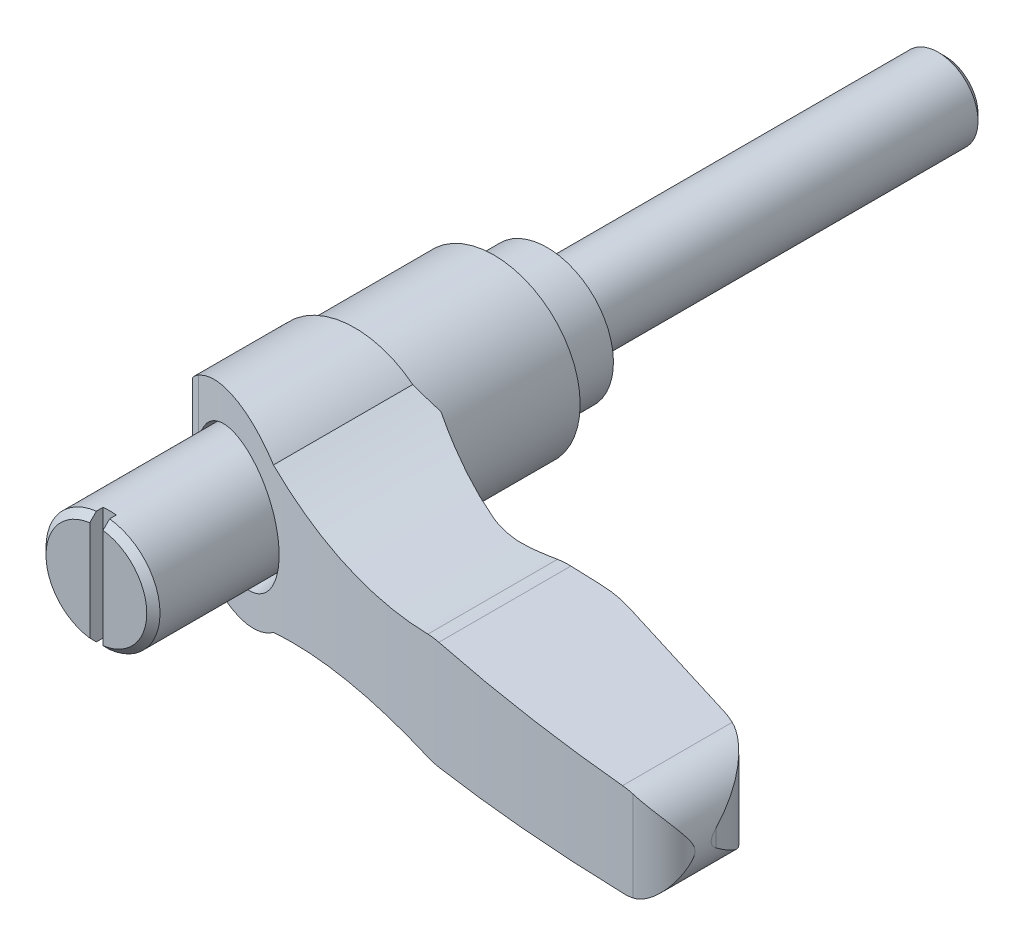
ISO-10303-21;
HEADER;
FILE_DESCRIPTION(('STEP AP214'),'2;1');
FILE_NAME('part.step','',(''),(''),'','','');
FILE_SCHEMA(('AUTOMOTIVE_DESIGN { 1 0 10303 214 1 1 1 1 }'));
ENDSEC;
DATA;
#1=APPLICATION_CONTEXT('core data for automotive mechanical design processes');
#2=APPLICATION_PROTOCOL_DEFINITION('international standard','automotive_design',2000,#1);
#3=PRODUCT_CONTEXT('',#1,'mechanical');
#4=PRODUCT('Part','Part','',(#3));
#5=PRODUCT_RELATED_PRODUCT_CATEGORY('part','',(#4));
#6=PRODUCT_DEFINITION_FORMATION('','',#4);
#7=PRODUCT_DEFINITION_CONTEXT('part definition',#1,'design');
#8=PRODUCT_DEFINITION('design','',#6,#7);
#9=PRODUCT_DEFINITION_SHAPE('','',#8);
#10=(LENGTH_UNIT() NAMED_UNIT(*) SI_UNIT(.MILLI.,.METRE.));
#11=(NAMED_UNIT(*) PLANE_ANGLE_UNIT() SI_UNIT($,.RADIAN.));
#12=(NAMED_UNIT(*) SI_UNIT($,.STERADIAN.) SOLID_ANGLE_UNIT());
#13=UNCERTAINTY_MEASURE_WITH_UNIT(LENGTH_MEASURE(1.E-05),#10,'distance_accuracy_value','');
#14=(GEOMETRIC_REPRESENTATION_CONTEXT(3) GLOBAL_UNCERTAINTY_ASSIGNED_CONTEXT((#13)) GLOBAL_UNIT_ASSIGNED_CONTEXT((#10,
#11,#12)) REPRESENTATION_CONTEXT('',''));
#15=CARTESIAN_POINT('',(0.,0.,0.));
#16=DIRECTION('',(0.,0.,1.));
#17=DIRECTION('',(1.,0.,0.));
#18=AXIS2_PLACEMENT_3D('',#15,#16,#17);
#19=CARTESIAN_POINT('',(0.,0.,-30.));
#20=DIRECTION('',(0.,0.,-1.));
#21=DIRECTION('',(0.,1.,0.));
#22=AXIS2_PLACEMENT_3D('',#19,#20,#21);
#23=PLANE('',#22);
#24=CARTESIAN_POINT('',(0.,0.,-30.));
#25=DIRECTION('',(0.,0.,-1.));
#26=DIRECTION('',(0.,1.,0.));
#27=AXIS2_PLACEMENT_3D('',#24,#25,#26);
#28=CIRCLE('',#27,2.5);
#29=CARTESIAN_POINT('',(0.,2.5,-30.));
#30=VERTEX_POINT('',#29);
#31=EDGE_CURVE('E688',#30,#30,#28,.T.);
#32=ORIENTED_EDGE('',*,*,#31,.T.);
#33=EDGE_LOOP('',(#32));
#34=FACE_BOUND('',#33,.T.);
#35=ADVANCED_FACE('F14',(#34),#23,.T.);
#36=CARTESIAN_POINT('',(0.,0.,-30.));
#37=DIRECTION('',(0.,0.,1.));
#38=DIRECTION('',(0.,-1.,0.));
#39=AXIS2_PLACEMENT_3D('',#36,#37,#38);
#40=CONICAL_SURFACE('',#39,2.5,0.785398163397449);
#41=CARTESIAN_POINT('',(0.,0.,-29.5));
#42=DIRECTION('',(0.,0.,-1.));
#43=DIRECTION('',(0.,1.,0.));
#44=AXIS2_PLACEMENT_3D('',#41,#42,#43);
#45=CIRCLE('',#44,3.);
#46=CARTESIAN_POINT('',(0.,3.,-29.5));
#47=VERTEX_POINT('',#46);
#48=EDGE_CURVE('E18',#47,#47,#45,.F.);
#49=ORIENTED_EDGE('',*,*,#48,.F.);
#50=EDGE_LOOP('',(#49));
#51=FACE_BOUND('',#50,.T.);
#52=ORIENTED_EDGE('',*,*,#31,.F.);
#53=EDGE_LOOP('',(#52));
#54=FACE_BOUND('',#53,.T.);
#55=ADVANCED_FACE('F731',(#51,#54),#40,.T.);
#56=CARTESIAN_POINT('',(0.,0.,-30.));
#57=DIRECTION('',(0.,0.,1.));
#58=DIRECTION('',(0.,-1.,0.));
#59=AXIS2_PLACEMENT_3D('',#56,#57,#58);
#60=CYLINDRICAL_SURFACE('',#59,3.);
#61=ORIENTED_EDGE('',*,*,#48,.T.);
#62=EDGE_LOOP('',(#61));
#63=FACE_BOUND('',#62,.T.);
#64=CARTESIAN_POINT('',(0.,0.,0.));
#65=DIRECTION('',(0.,0.,-1.));
#66=DIRECTION('',(0.,1.,0.));
#67=AXIS2_PLACEMENT_3D('',#64,#65,#66);
#68=CIRCLE('',#67,3.);
#69=CARTESIAN_POINT('',(0.,3.,0.));
#70=VERTEX_POINT('',#69);
#71=EDGE_CURVE('E618',#70,#70,#68,.T.);
#72=ORIENTED_EDGE('',*,*,#71,.T.);
#73=EDGE_LOOP('',(#72));
#74=FACE_BOUND('',#73,.T.);
#75=ADVANCED_FACE('F717',(#63,#74),#60,.T.);
#76=CARTESIAN_POINT('',(5.,0.,0.));
#77=DIRECTION('',(0.,0.,-1.));
#78=DIRECTION('',(0.,1.,0.));
#79=AXIS2_PLACEMENT_3D('',#76,#77,#78);
#80=PLANE('',#79);
#81=CARTESIAN_POINT('',(0.,0.,0.));
#82=DIRECTION('',(0.,0.,1.));
#83=DIRECTION('',(0.,-1.,0.));
#84=AXIS2_PLACEMENT_3D('',#81,#82,#83);
#85=CIRCLE('',#84,5.);
#86=CARTESIAN_POINT('',(0.,-5.,0.));
#87=VERTEX_POINT('',#86);
#88=EDGE_CURVE('E637',#87,#87,#85,.T.);
#89=ORIENTED_EDGE('',*,*,#88,.F.);
#90=EDGE_LOOP('',(#89));
#91=FACE_BOUND('',#90,.T.);
#92=ORIENTED_EDGE('',*,*,#71,.F.);
#93=EDGE_LOOP('',(#92));
#94=FACE_BOUND('',#93,.T.);
#95=ADVANCED_FACE('F715',(#91,#94),#80,.T.);
#96=CARTESIAN_POINT('',(0.,0.,4.));
#97=DIRECTION('',(0.,0.,1.));
#98=DIRECTION('',(0.,-1.,0.));
#99=AXIS2_PLACEMENT_3D('',#96,#97,#98);
#100=CYLINDRICAL_SURFACE('',#99,5.);
#101=ORIENTED_EDGE('',*,*,#88,.T.);
#102=EDGE_LOOP('',(#101));
#103=FACE_BOUND('',#102,.T.);
#104=CARTESIAN_POINT('',(0.,0.,4.55));
#105=DIRECTION('',(0.,0.,1.));
#106=DIRECTION('',(0.,-1.,0.));
#107=AXIS2_PLACEMENT_3D('',#104,#105,#106);
#108=CIRCLE('',#107,5.);
#109=CARTESIAN_POINT('',(0.,-5.,4.55));
#110=VERTEX_POINT('',#109);
#111=EDGE_CURVE('E596',#110,#110,#108,.T.);
#112=ORIENTED_EDGE('',*,*,#111,.F.);
#113=EDGE_LOOP('',(#112));
#114=FACE_BOUND('',#113,.T.);
#115=ADVANCED_FACE('F712',(#103,#114),#100,.T.);
#116=CARTESIAN_POINT('',(0.,0.,34.));
#117=DIRECTION('',(0.,0.,-1.));
#118=DIRECTION('',(0.,1.,0.));
#119=AXIS2_PLACEMENT_3D('',#116,#117,#118);
#120=PLANE('',#119);
#121=CARTESIAN_POINT('',(0.,0.,34.));
#122=DIRECTION('',(0.,0.,-1.));
#123=DIRECTION('',(0.,1.,0.));
#124=AXIS2_PLACEMENT_3D('',#121,#122,#123);
#125=CIRCLE('',#124,3.8);
#126=CARTESIAN_POINT('',(0.5,-3.76696164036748,34.));
#127=VERTEX_POINT('',#126);
#128=CARTESIAN_POINT('',(0.5,3.76696164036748,34.));
#129=VERTEX_POINT('',#128);
#130=EDGE_CURVE('E644',#127,#129,#125,.F.);
#131=ORIENTED_EDGE('',*,*,#130,.T.);
#132=DIRECTION('',(0.,1.,0.));
#133=VECTOR('',#132,1.);
#134=CARTESIAN_POINT('',(0.5,5.,34.));
#135=LINE('',#134,#133);
#136=EDGE_CURVE('E623',#127,#129,#135,.T.);
#137=ORIENTED_EDGE('',*,*,#136,.F.);
#138=EDGE_LOOP('',(#131,#137));
#139=FACE_BOUND('',#138,.T.);
#140=ADVANCED_FACE('F706',(#139),#120,.F.);
#141=CARTESIAN_POINT('',(-0.5,3.76696164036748,34.));
#142=VERTEX_POINT('',#141);
#143=CARTESIAN_POINT('',(-0.5,-3.76696164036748,34.));
#144=VERTEX_POINT('',#143);
#145=EDGE_CURVE('E645',#142,#144,#125,.F.);
#146=ORIENTED_EDGE('',*,*,#145,.T.);
#147=DIRECTION('',(0.,-1.,0.));
#148=VECTOR('',#147,1.);
#149=CARTESIAN_POINT('',(-0.5,5.,34.));
#150=LINE('',#149,#148);
#151=EDGE_CURVE('E621',#142,#144,#150,.T.);
#152=ORIENTED_EDGE('',*,*,#151,.F.);
#153=EDGE_LOOP('',(#146,#152));
#154=FACE_BOUND('',#153,.T.);
#155=ADVANCED_FACE('F704',(#154),#120,.F.);
#156=CARTESIAN_POINT('',(0.,0.,33.5));
#157=DIRECTION('',(0.,0.,-1.));
#158=DIRECTION('',(0.,1.,0.));
#159=AXIS2_PLACEMENT_3D('',#156,#157,#158);
#160=CONICAL_SURFACE('',#159,4.3,0.785398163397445);
#161=CARTESIAN_POINT('',(-0.5,7.14579003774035,30.6367385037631));
#162=CARTESIAN_POINT('',(-0.5,6.87469589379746,30.907163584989));
#163=CARTESIAN_POINT('',(-0.5,6.60357153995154,31.1775584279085));
#164=CARTESIAN_POINT('',(-0.5,6.0612255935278,31.7182262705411));
#165=CARTESIAN_POINT('',(-0.5,5.79000400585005,31.9884992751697));
#166=CARTESIAN_POINT('',(-0.5,5.24743596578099,32.5288529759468));
#167=CARTESIAN_POINT('',(-0.5,4.97608953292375,32.7989336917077));
#168=CARTESIAN_POINT('',(-0.5,4.43313294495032,33.3388536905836));
#169=CARTESIAN_POINT('',(-0.5,4.16152277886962,33.6086929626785));
#170=CARTESIAN_POINT('',(-0.5,3.75373708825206,34.0131478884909));
#171=CARTESIAN_POINT('',(-0.5,3.61772939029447,34.1479327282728));
#172=CARTESIAN_POINT('',(-0.5,3.34555849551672,34.41734068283));
#173=CARTESIAN_POINT('',(-0.5,3.20939530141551,34.5519638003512));
#174=CARTESIAN_POINT('',(-0.5,2.93685991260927,34.8209619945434));
#175=CARTESIAN_POINT('',(-0.5,2.80048774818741,34.9553371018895));
#176=CARTESIAN_POINT('',(-0.5,2.52739320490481,35.2237482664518));
#177=CARTESIAN_POINT('',(-0.5,2.39067080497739,35.3577843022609));
#178=CARTESIAN_POINT('',(-0.5,2.18513448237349,35.5584388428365));
#179=CARTESIAN_POINT('',(-0.5,2.11653083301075,35.6252726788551));
#180=CARTESIAN_POINT('',(-0.5,1.97913719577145,35.7587462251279));
#181=CARTESIAN_POINT('',(-0.5,1.91034721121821,35.8253859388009));
#182=CARTESIAN_POINT('',(-0.5,1.77252789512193,35.9583896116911));
#183=CARTESIAN_POINT('',(-0.5,1.70349861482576,36.0247536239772));
#184=CARTESIAN_POINT('',(-0.5,1.56508132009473,36.1571160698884));
#185=CARTESIAN_POINT('',(-0.5,1.49569328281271,36.223114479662));
#186=CARTESIAN_POINT('',(-0.5,1.35634903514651,36.3546106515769));
#187=CARTESIAN_POINT('',(-0.5,1.28639245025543,36.4201080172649));
#188=CARTESIAN_POINT('',(-0.5,1.14569948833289,36.5502396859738));
#189=CARTESIAN_POINT('',(-0.5,1.07496325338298,36.6148741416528));
#190=CARTESIAN_POINT('',(-0.5,0.967839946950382,36.7107505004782));
#191=CARTESIAN_POINT('',(-0.5,0.931946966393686,36.7425432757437));
#192=CARTESIAN_POINT('',(-0.5,0.859716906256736,36.8056137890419));
#193=CARTESIAN_POINT('',(-0.5,0.823379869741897,36.8368915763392));
#194=CARTESIAN_POINT('',(-0.5,0.750082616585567,36.8987629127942));
#195=CARTESIAN_POINT('',(-0.5,0.713122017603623,36.9293560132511));
#196=CARTESIAN_POINT('',(-0.5,0.638313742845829,36.9894602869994));
#197=CARTESIAN_POINT('',(-0.5,0.600465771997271,37.0189710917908));
#198=CARTESIAN_POINT('',(-0.5,0.562043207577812,37.0477416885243));
#199=B_SPLINE_CURVE_WITH_KNOTS('',3,(#161,#162,#163,#164,#165,#166,#167,#168,#169,#170,#171,
#172,#173,#174,#175,#176,#177,#178,#179,#180,#181,#182,#183,#184,#185,#186,#187,#188,#189,#190,
#191,#192,#193,#194,#195,#196,#197,#198),.UNSPECIFIED.,.F.,.F.,(4,2,2,2,2,2,2,2,2,2,2,2,2,2,2,2,
2,2,4),(0.,1.14873667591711,2.29742189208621,3.44596538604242,4.59455887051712,5.1690023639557,
5.74343596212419,6.31779297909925,6.89218539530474,7.17951595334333,7.46684142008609,
7.75410874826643,8.04139460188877,8.32888815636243,8.61633015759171,8.76017280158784,
8.90400160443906,9.04792205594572,9.19189106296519),.UNSPECIFIED.);
#200=CARTESIAN_POINT('',(-0.5,4.27083130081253,33.5));
#201=VERTEX_POINT('',#200);
#202=EDGE_CURVE('E679',#201,#142,#199,.T.);
#203=ORIENTED_EDGE('',*,*,#202,.F.);
#204=CARTESIAN_POINT('',(0.,0.,33.5));
#205=DIRECTION('',(0.,0.,-1.));
#206=DIRECTION('',(0.,1.,0.));
#207=AXIS2_PLACEMENT_3D('',#204,#205,#206);
#208=CIRCLE('',#207,4.3);
#209=CARTESIAN_POINT('',(-0.5,-4.27083130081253,33.5));
#210=VERTEX_POINT('',#209);
#211=EDGE_CURVE('E640',#210,#201,#208,.T.);
#212=ORIENTED_EDGE('',*,*,#211,.F.);
#213=CARTESIAN_POINT('',(-0.5,-0.562043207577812,37.0477416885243));
#214=CARTESIAN_POINT('',(-0.5,-0.591562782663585,37.0256612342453));
#215=CARTESIAN_POINT('',(-0.5,-0.620732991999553,37.0031254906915));
#216=CARTESIAN_POINT('',(-0.5,-0.678508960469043,36.9573533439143));
#217=CARTESIAN_POINT('',(-0.5,-0.707114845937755,36.9341171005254));
#218=CARTESIAN_POINT('',(-0.5,-0.763893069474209,36.8871574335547));
#219=CARTESIAN_POINT('',(-0.5,-0.792065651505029,36.8634343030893));
#220=CARTESIAN_POINT('',(-0.5,-0.848085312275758,36.8156036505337));
#221=CARTESIAN_POINT('',(-0.5,-0.875932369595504,36.7914961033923));
#222=CARTESIAN_POINT('',(-0.5,-0.959051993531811,36.7187712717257));
#223=CARTESIAN_POINT('',(-0.5,-1.0139429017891,36.669718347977));
#224=CARTESIAN_POINT('',(-0.5,-1.12306845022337,36.5708712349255));
#225=CARTESIAN_POINT('',(-0.5,-1.17730296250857,36.5210769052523));
#226=CARTESIAN_POINT('',(-0.5,-1.34475427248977,36.3659472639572));
#227=CARTESIAN_POINT('',(-0.5,-1.4572060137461,36.2597875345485));
#228=CARTESIAN_POINT('',(-0.5,-1.68111383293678,36.0464226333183));
#229=CARTESIAN_POINT('',(-0.5,-1.79256987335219,35.9392174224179));
#230=CARTESIAN_POINT('',(-0.5,-2.01488759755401,35.7241936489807));
#231=CARTESIAN_POINT('',(-0.5,-2.12574928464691,35.6163750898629));
#232=CARTESIAN_POINT('',(-0.5,-2.34709619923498,35.4003567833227));
#233=CARTESIAN_POINT('',(-0.5,-2.45758143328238,35.2921570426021));
#234=CARTESIAN_POINT('',(-0.5,-2.78891994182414,34.9669349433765));
#235=CARTESIAN_POINT('',(-0.5,-3.00940313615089,34.7495356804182));
#236=CARTESIAN_POINT('',(-0.5,-3.44986918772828,34.3142422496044));
#237=CARTESIAN_POINT('',(-0.5,-3.66985205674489,34.096348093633));
#238=CARTESIAN_POINT('',(-0.5,-4.16175150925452,33.6084656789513));
#239=CARTESIAN_POINT('',(-0.5,-4.43359041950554,33.3383991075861));
#240=CARTESIAN_POINT('',(-0.5,-4.97701825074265,32.798009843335));
#241=CARTESIAN_POINT('',(-0.5,-5.24860716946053,32.5276871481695));
#242=CARTESIAN_POINT('',(-0.5,-5.79118913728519,31.9873183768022));
#243=CARTESIAN_POINT('',(-0.5,-6.06218244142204,31.7172725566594));
#244=CARTESIAN_POINT('',(-0.5,-6.60405724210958,31.1770740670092));
#245=CARTESIAN_POINT('',(-0.5,-6.87493873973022,30.9069213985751));
#246=CARTESIAN_POINT('',(-0.5,-7.14579003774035,30.6367385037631));
#247=B_SPLINE_CURVE_WITH_KNOTS('',3,(#213,#214,#215,#216,#217,#218,#219,#220,#221,#222,#223,
#224,#225,#226,#227,#228,#229,#230,#231,#232,#233,#234,#235,#236,#237,#238,#239,#240,#241,#242,
#243,#244,#245,#246),.UNSPECIFIED.,.F.,.F.,(4,2,2,2,2,2,2,2,2,2,2,2,2,2,2,2,4),(0.,
0.110577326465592,0.221129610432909,0.331617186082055,0.442111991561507,0.662945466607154,
0.883821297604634,1.34774036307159,1.81167683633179,2.27561072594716,2.7395364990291,
3.66844637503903,4.59733417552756,5.74689505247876,6.8964662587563,8.04418527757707,
9.19189304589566),.UNSPECIFIED.);
#248=EDGE_CURVE('E673',#144,#210,#247,.T.);
#249=ORIENTED_EDGE('',*,*,#248,.F.);
#250=ORIENTED_EDGE('',*,*,#145,.F.);
#251=EDGE_LOOP('',(#203,#212,#249,#250));
#252=FACE_BOUND('',#251,.T.);
#253=ADVANCED_FACE('F700',(#252),#160,.T.);
#254=CARTESIAN_POINT('',(0.5,0.562043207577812,37.0477416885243));
#255=CARTESIAN_POINT('',(0.5,0.591562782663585,37.0256612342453));
#256=CARTESIAN_POINT('',(0.5,0.620732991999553,37.0031254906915));
#257=CARTESIAN_POINT('',(0.5,0.678508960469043,36.9573533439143));
#258=CARTESIAN_POINT('',(0.5,0.707114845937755,36.9341171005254));
#259=CARTESIAN_POINT('',(0.5,0.763893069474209,36.8871574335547));
#260=CARTESIAN_POINT('',(0.5,0.792065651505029,36.8634343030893));
#261=CARTESIAN_POINT('',(0.5,0.848085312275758,36.8156036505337));
#262=CARTESIAN_POINT('',(0.5,0.875932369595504,36.7914961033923));
#263=CARTESIAN_POINT('',(0.5,0.959051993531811,36.7187712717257));
#264=CARTESIAN_POINT('',(0.5,1.0139429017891,36.669718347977));
#265=CARTESIAN_POINT('',(0.5,1.12306845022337,36.5708712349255));
#266=CARTESIAN_POINT('',(0.5,1.17730296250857,36.5210769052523));
#267=CARTESIAN_POINT('',(0.5,1.34475427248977,36.3659472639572));
#268=CARTESIAN_POINT('',(0.5,1.4572060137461,36.2597875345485));
#269=CARTESIAN_POINT('',(0.5,1.68111383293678,36.0464226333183));
#270=CARTESIAN_POINT('',(0.5,1.79256987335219,35.9392174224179));
#271=CARTESIAN_POINT('',(0.5,2.01488759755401,35.7241936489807));
#272=CARTESIAN_POINT('',(0.5,2.12574928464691,35.6163750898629));
#273=CARTESIAN_POINT('',(0.5,2.34709619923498,35.4003567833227));
#274=CARTESIAN_POINT('',(0.5,2.45758143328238,35.2921570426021));
#275=CARTESIAN_POINT('',(0.5,2.78891994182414,34.9669349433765));
#276=CARTESIAN_POINT('',(0.5,3.00940313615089,34.7495356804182));
#277=CARTESIAN_POINT('',(0.5,3.44986918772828,34.3142422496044));
#278=CARTESIAN_POINT('',(0.5,3.66985205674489,34.096348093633));
#279=CARTESIAN_POINT('',(0.5,4.16175150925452,33.6084656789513));
#280=CARTESIAN_POINT('',(0.5,4.43359041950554,33.3383991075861));
#281=CARTESIAN_POINT('',(0.5,4.97701825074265,32.798009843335));
#282=CARTESIAN_POINT('',(0.5,5.24860716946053,32.5276871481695));
#283=CARTESIAN_POINT('',(0.5,5.79118913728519,31.9873183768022));
#284=CARTESIAN_POINT('',(0.5,6.06218244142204,31.7172725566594));
#285=CARTESIAN_POINT('',(0.5,6.60405724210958,31.1770740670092));
#286=CARTESIAN_POINT('',(0.5,6.87493873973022,30.9069213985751));
#287=CARTESIAN_POINT('',(0.5,7.14579003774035,30.6367385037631));
#288=B_SPLINE_CURVE_WITH_KNOTS('',3,(#254,#255,#256,#257,#258,#259,#260,#261,#262,#263,#264,
#265,#266,#267,#268,#269,#270,#271,#272,#273,#274,#275,#276,#277,#278,#279,#280,#281,#282,#283,
#284,#285,#286,#287),.UNSPECIFIED.,.F.,.F.,(4,2,2,2,2,2,2,2,2,2,2,2,2,2,2,2,4),(0.,
0.110577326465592,0.221129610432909,0.331617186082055,0.442111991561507,0.662945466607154,
0.883821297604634,1.34774036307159,1.81167683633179,2.27561072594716,2.7395364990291,
3.66844637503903,4.59733417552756,5.74689505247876,6.8964662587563,8.04418527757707,
9.19189304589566),.UNSPECIFIED.);
#289=CARTESIAN_POINT('',(0.5,4.27083130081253,33.5));
#290=VERTEX_POINT('',#289);
#291=EDGE_CURVE('E656',#129,#290,#288,.T.);
#292=ORIENTED_EDGE('',*,*,#291,.F.);
#293=ORIENTED_EDGE('',*,*,#130,.F.);
#294=CARTESIAN_POINT('',(0.5,-7.14579003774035,30.6367385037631));
#295=CARTESIAN_POINT('',(0.5,-6.87469589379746,30.907163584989));
#296=CARTESIAN_POINT('',(0.5,-6.60357153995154,31.1775584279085));
#297=CARTESIAN_POINT('',(0.5,-6.0612255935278,31.7182262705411));
#298=CARTESIAN_POINT('',(0.5,-5.79000400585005,31.9884992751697));
#299=CARTESIAN_POINT('',(0.5,-5.24743596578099,32.5288529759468));
#300=CARTESIAN_POINT('',(0.5,-4.97608953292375,32.7989336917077));
#301=CARTESIAN_POINT('',(0.5,-4.43313294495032,33.3388536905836));
#302=CARTESIAN_POINT('',(0.5,-4.16152277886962,33.6086929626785));
#303=CARTESIAN_POINT('',(0.5,-3.75373708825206,34.0131478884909));
#304=CARTESIAN_POINT('',(0.5,-3.61772939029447,34.1479327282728));
#305=CARTESIAN_POINT('',(0.5,-3.34555849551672,34.41734068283));
#306=CARTESIAN_POINT('',(0.5,-3.20939530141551,34.5519638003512));
#307=CARTESIAN_POINT('',(0.5,-2.93685991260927,34.8209619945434));
#308=CARTESIAN_POINT('',(0.5,-2.80048774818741,34.9553371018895));
#309=CARTESIAN_POINT('',(0.5,-2.52739320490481,35.2237482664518));
#310=CARTESIAN_POINT('',(0.5,-2.39067080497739,35.3577843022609));
#311=CARTESIAN_POINT('',(0.5,-2.18513448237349,35.5584388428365));
#312=CARTESIAN_POINT('',(0.5,-2.11653083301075,35.6252726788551));
#313=CARTESIAN_POINT('',(0.5,-1.97913719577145,35.7587462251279));
#314=CARTESIAN_POINT('',(0.5,-1.91034721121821,35.8253859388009));
#315=CARTESIAN_POINT('',(0.5,-1.77252789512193,35.9583896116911));
#316=CARTESIAN_POINT('',(0.5,-1.70349861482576,36.0247536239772));
#317=CARTESIAN_POINT('',(0.5,-1.56508132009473,36.1571160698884));
#318=CARTESIAN_POINT('',(0.5,-1.49569328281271,36.223114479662));
#319=CARTESIAN_POINT('',(0.5,-1.35634903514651,36.3546106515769));
#320=CARTESIAN_POINT('',(0.5,-1.28639245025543,36.4201080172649));
#321=CARTESIAN_POINT('',(0.5,-1.14569948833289,36.5502396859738));
#322=CARTESIAN_POINT('',(0.5,-1.07496325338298,36.6148741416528));
#323=CARTESIAN_POINT('',(0.5,-0.967839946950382,36.7107505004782));
#324=CARTESIAN_POINT('',(0.5,-0.931946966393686,36.7425432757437));
#325=CARTESIAN_POINT('',(0.5,-0.859716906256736,36.8056137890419));
#326=CARTESIAN_POINT('',(0.5,-0.823379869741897,36.8368915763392));
#327=CARTESIAN_POINT('',(0.5,-0.750082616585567,36.8987629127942));
#328=CARTESIAN_POINT('',(0.5,-0.713122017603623,36.9293560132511));
#329=CARTESIAN_POINT('',(0.5,-0.638313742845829,36.9894602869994));
#330=CARTESIAN_POINT('',(0.5,-0.600465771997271,37.0189710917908));
#331=CARTESIAN_POINT('',(0.5,-0.562043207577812,37.0477416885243));
#332=B_SPLINE_CURVE_WITH_KNOTS('',3,(#294,#295,#296,#297,#298,#299,#300,#301,#302,#303,#304,
#305,#306,#307,#308,#309,#310,#311,#312,#313,#314,#315,#316,#317,#318,#319,#320,#321,#322,#323,
#324,#325,#326,#327,#328,#329,#330,#331),.UNSPECIFIED.,.F.,.F.,(4,2,2,2,2,2,2,2,2,2,2,2,2,2,2,2,
2,2,4),(0.,1.14873667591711,2.29742189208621,3.44596538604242,4.59455887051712,5.1690023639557,
5.74343596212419,6.31779297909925,6.89218539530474,7.17951595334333,7.46684142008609,
7.75410874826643,8.04139460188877,8.32888815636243,8.61633015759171,8.76017280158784,
8.90400160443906,9.04792205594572,9.19189106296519),.UNSPECIFIED.);
#333=CARTESIAN_POINT('',(0.5,-4.27083130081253,33.5));
#334=VERTEX_POINT('',#333);
#335=EDGE_CURVE('E648',#334,#127,#332,.T.);
#336=ORIENTED_EDGE('',*,*,#335,.F.);
#337=EDGE_CURVE('E641',#290,#334,#208,.T.);
#338=ORIENTED_EDGE('',*,*,#337,.F.);
#339=EDGE_LOOP('',(#292,#293,#336,#338));
#340=FACE_BOUND('',#339,.T.);
#341=ADVANCED_FACE('F662',(#340),#160,.T.);
#342=CARTESIAN_POINT('',(0.5,5.,33.));
#343=DIRECTION('',(1.,0.,0.));
#344=DIRECTION('',(0.,1.,0.));
#345=AXIS2_PLACEMENT_3D('',#342,#343,#344);
#346=PLANE('',#345);
#347=DIRECTION('',(0.,0.,1.));
#348=VECTOR('',#347,1.);
#349=CARTESIAN_POINT('',(0.5,4.27083130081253,4.));
#350=LINE('',#349,#348);
#351=CARTESIAN_POINT('',(0.5,4.27083130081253,33.));
#352=VERTEX_POINT('',#351);
#353=EDGE_CURVE('E632',#290,#352,#350,.F.);
#354=ORIENTED_EDGE('',*,*,#353,.T.);
#355=DIRECTION('',(0.,1.,0.));
#356=VECTOR('',#355,1.);
#357=CARTESIAN_POINT('',(0.5,5.,33.));
#358=LINE('',#357,#356);
#359=CARTESIAN_POINT('',(0.5,-4.27083130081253,33.));
#360=VERTEX_POINT('',#359);
#361=EDGE_CURVE('E628',#360,#352,#358,.T.);
#362=ORIENTED_EDGE('',*,*,#361,.F.);
#363=DIRECTION('',(0.,0.,1.));
#364=VECTOR('',#363,1.);
#365=CARTESIAN_POINT('',(0.5,-4.27083130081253,4.));
#366=LINE('',#365,#364);
#367=EDGE_CURVE('E79',#360,#334,#366,.T.);
#368=ORIENTED_EDGE('',*,*,#367,.T.);
#369=ORIENTED_EDGE('',*,*,#335,.T.);
#370=ORIENTED_EDGE('',*,*,#136,.T.);
#371=ORIENTED_EDGE('',*,*,#291,.T.);
#372=EDGE_LOOP('',(#354,#362,#368,#369,#370,#371));
#373=FACE_BOUND('',#372,.T.);
#374=ADVANCED_FACE('F665',(#373),#346,.F.);
#375=CARTESIAN_POINT('',(-0.5,-5.,33.));
#376=DIRECTION('',(0.,0.,1.));
#377=DIRECTION('',(0.,-1.,0.));
#378=AXIS2_PLACEMENT_3D('',#375,#376,#377);
#379=PLANE('',#378);
#380=DIRECTION('',(0.,-1.,0.));
#381=VECTOR('',#380,1.);
#382=CARTESIAN_POINT('',(-0.5,5.,33.));
#383=LINE('',#382,#381);
#384=CARTESIAN_POINT('',(-0.5,4.27083130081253,33.));
#385=VERTEX_POINT('',#384);
#386=CARTESIAN_POINT('',(-0.5,-4.27083130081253,33.));
#387=VERTEX_POINT('',#386);
#388=EDGE_CURVE('E625',#385,#387,#383,.T.);
#389=ORIENTED_EDGE('',*,*,#388,.T.);
#390=CARTESIAN_POINT('',(0.,0.,33.));
#391=DIRECTION('',(0.,0.,1.));
#392=DIRECTION('',(0.,-1.,0.));
#393=AXIS2_PLACEMENT_3D('',#390,#391,#392);
#394=CIRCLE('',#393,4.3);
#395=EDGE_CURVE('E685',#360,#387,#394,.F.);
#396=ORIENTED_EDGE('',*,*,#395,.F.);
#397=ORIENTED_EDGE('',*,*,#361,.T.);
#398=EDGE_CURVE('E687',#385,#352,#394,.F.);
#399=ORIENTED_EDGE('',*,*,#398,.F.);
#400=EDGE_LOOP('',(#389,#396,#397,#399));
#401=FACE_BOUND('',#400,.T.);
#402=ADVANCED_FACE('F587',(#401),#379,.T.);
#403=CARTESIAN_POINT('',(-0.5,5.,33.));
#404=DIRECTION('',(-1.,0.,0.));
#405=DIRECTION('',(0.,-1.,0.));
#406=AXIS2_PLACEMENT_3D('',#403,#404,#405);
#407=PLANE('',#406);
#408=DIRECTION('',(0.,0.,1.));
#409=VECTOR('',#408,1.);
#410=CARTESIAN_POINT('',(-0.5,4.27083130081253,4.));
#411=LINE('',#410,#409);
#412=EDGE_CURVE('E72',#385,#201,#411,.T.);
#413=ORIENTED_EDGE('',*,*,#412,.T.);
#414=ORIENTED_EDGE('',*,*,#202,.T.);
#415=ORIENTED_EDGE('',*,*,#151,.T.);
#416=ORIENTED_EDGE('',*,*,#248,.T.);
#417=DIRECTION('',(0.,0.,1.));
#418=VECTOR('',#417,1.);
#419=CARTESIAN_POINT('',(-0.5,-4.27083130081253,4.));
#420=LINE('',#419,#418);
#421=EDGE_CURVE('E634',#210,#387,#420,.F.);
#422=ORIENTED_EDGE('',*,*,#421,.T.);
#423=ORIENTED_EDGE('',*,*,#388,.F.);
#424=EDGE_LOOP('',(#413,#414,#415,#416,#422,#423));
#425=FACE_BOUND('',#424,.T.);
#426=ADVANCED_FACE('F581',(#425),#407,.F.);
#427=CARTESIAN_POINT('',(0.,0.,4.));
#428=DIRECTION('',(0.,0.,1.));
#429=DIRECTION('',(0.,-1.,0.));
#430=AXIS2_PLACEMENT_3D('',#427,#428,#429);
#431=CYLINDRICAL_SURFACE('',#430,4.3);
#432=ORIENTED_EDGE('',*,*,#412,.F.);
#433=ORIENTED_EDGE('',*,*,#398,.T.);
#434=ORIENTED_EDGE('',*,*,#353,.F.);
#435=ORIENTED_EDGE('',*,*,#337,.T.);
#436=ORIENTED_EDGE('',*,*,#367,.F.);
#437=ORIENTED_EDGE('',*,*,#395,.T.);
#438=ORIENTED_EDGE('',*,*,#421,.F.);
#439=ORIENTED_EDGE('',*,*,#211,.T.);
#440=EDGE_LOOP('',(#432,#433,#434,#435,#436,#437,#438,#439));
#441=FACE_BOUND('',#440,.T.);
#442=CARTESIAN_POINT('',(0.,0.,21.34));
#443=DIRECTION('',(0.,0.,1.));
#444=DIRECTION('',(0.,-1.,0.));
#445=AXIS2_PLACEMENT_3D('',#442,#443,#444);
#446=CIRCLE('',#445,4.3);
#447=CARTESIAN_POINT('',(0.,-4.3,21.34));
#448=VERTEX_POINT('',#447);
#449=EDGE_CURVE('E594',#448,#448,#446,.T.);
#450=ORIENTED_EDGE('',*,*,#449,.T.);
#451=EDGE_LOOP('',(#450));
#452=FACE_BOUND('',#451,.T.);
#453=ADVANCED_FACE('F16',(#441,#452),#431,.T.);
#454=CARTESIAN_POINT('',(39.938965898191,-8.,27.204249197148));
#455=DIRECTION('',(-0.989626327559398,0.,0.143665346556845));
#456=DIRECTION('',(-0.143665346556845,0.,-0.989626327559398));
#457=AXIS2_PLACEMENT_3D('',#454,#455,#456);
#458=PLANE('',#457);
#459=CARTESIAN_POINT('',(36.5,0.,3.51522972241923));
#460=DIRECTION('',(-0.989626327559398,0.,0.143665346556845));
#461=DIRECTION('',(0.143665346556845,0.,0.989626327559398));
#462=AXIS2_PLACEMENT_3D('',#459,#460,#461);
#463=ELLIPSE('',#462,24.3621728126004,3.5);
#464=CARTESIAN_POINT('',(39.938965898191,-0.650779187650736,27.204249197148));
#465=VERTEX_POINT('',#464);
#466=CARTESIAN_POINT('',(39.938965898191,0.650779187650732,27.204249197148));
#467=VERTEX_POINT('',#466);
#468=EDGE_CURVE('E404',#465,#467,#463,.T.);
#469=ORIENTED_EDGE('',*,*,#468,.F.);
#470=DIRECTION('',(0.,1.,0.));
#471=VECTOR('',#470,1.);
#472=CARTESIAN_POINT('',(39.938965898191,-8.,27.204249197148));
#473=LINE('',#472,#471);
#474=EDGE_CURVE('E249',#465,#467,#473,.T.);
#475=ORIENTED_EDGE('',*,*,#474,.T.);
#476=EDGE_LOOP('',(#469,#475));
#477=FACE_BOUND('',#476,.T.);
#478=ADVANCED_FACE('F415',(#477),#458,.F.);
#479=CARTESIAN_POINT('',(33.8626602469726,-8.,28.0863544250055));
#480=DIRECTION('',(0.,1.,0.));
#481=DIRECTION('',(-1.,0.,0.));
#482=AXIS2_PLACEMENT_3D('',#479,#480,#481);
#483=CYLINDRICAL_SURFACE('',#482,6.14000000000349);
#484=CARTESIAN_POINT('',(33.8626602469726,3.59762871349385,28.0863544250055));
#485=DIRECTION('',(0.0369925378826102,0.999315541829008,0.));
#486=DIRECTION('',(-0.999315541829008,0.0369925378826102,0.));
#487=AXIS2_PLACEMENT_3D('',#484,#485,#486);
#488=ELLIPSE('',#487,6.14420545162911,6.14000000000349);
#489=CARTESIAN_POINT('',(36.5,3.5,22.5416236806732));
#490=VERTEX_POINT('',#489);
#491=CARTESIAN_POINT('',(35.534460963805,3.53574220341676,22.178335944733));
#492=VERTEX_POINT('',#491);
#493=EDGE_CURVE('E574',#490,#492,#488,.T.);
#494=ORIENTED_EDGE('',*,*,#493,.F.);
#495=CARTESIAN_POINT('',(39.938965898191,0.650779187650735,27.204249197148));
#496=CARTESIAN_POINT('',(39.9247028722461,0.726086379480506,27.1059853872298));
#497=CARTESIAN_POINT('',(39.9079968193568,0.800887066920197,27.007686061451));
#498=CARTESIAN_POINT('',(39.8696347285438,0.949458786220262,26.8112602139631));
#499=CARTESIAN_POINT('',(39.8479781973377,1.02322971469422,26.7131337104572));
#500=CARTESIAN_POINT('',(39.7995979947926,1.16988012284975,26.5170899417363));
#501=CARTESIAN_POINT('',(39.7728626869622,1.24275713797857,26.4191736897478));
#502=CARTESIAN_POINT('',(39.7142815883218,1.38725410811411,26.2239599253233));
#503=CARTESIAN_POINT('',(39.6824358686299,1.45887408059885,26.1266624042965));
#504=CARTESIAN_POINT('',(39.5782917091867,1.67318502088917,25.8337016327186));
#505=CARTESIAN_POINT('',(39.4979263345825,1.81366367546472,25.6391889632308));
#506=CARTESIAN_POINT('',(39.3150854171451,2.08619457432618,25.2551202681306));
#507=CARTESIAN_POINT('',(39.2126344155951,2.21825596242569,25.0655590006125));
#508=CARTESIAN_POINT('',(38.9595027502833,2.49877334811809,24.6523338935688));
#509=CARTESIAN_POINT('',(38.8031801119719,2.64456339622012,24.4302018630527));
#510=CARTESIAN_POINT('',(38.5417124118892,2.84488994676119,24.108275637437));
#511=CARTESIAN_POINT('',(38.4501831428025,2.90854134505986,24.0029632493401));
#512=CARTESIAN_POINT('',(38.2579442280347,3.02861213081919,23.7967186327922));
#513=CARTESIAN_POINT('',(38.1572360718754,3.08503268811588,23.6957856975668));
#514=CARTESIAN_POINT('',(37.8892625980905,3.21757634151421,23.4457323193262));
#515=CARTESIAN_POINT('',(37.7155213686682,3.28779061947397,23.3001643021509));
#516=CARTESIAN_POINT('',(37.4396992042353,3.37286339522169,23.0946053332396));
#517=CARTESIAN_POINT('',(37.3453175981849,3.39783246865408,23.0282732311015));
#518=CARTESIAN_POINT('',(37.1517842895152,3.44019984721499,22.9003457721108));
#519=CARTESIAN_POINT('',(37.0526354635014,3.45760265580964,22.8387476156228));
#520=CARTESIAN_POINT('',(36.8781783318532,3.48029211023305,22.7372021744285));
#521=CARTESIAN_POINT('',(36.8038676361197,3.48759914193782,22.6959814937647));
#522=CARTESIAN_POINT('',(36.6533047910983,3.49745586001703,22.6165121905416));
#523=CARTESIAN_POINT('',(36.5770513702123,3.50000234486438,22.57826558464));
#524=CARTESIAN_POINT('',(36.5,3.5,22.5416236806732));
#525=B_SPLINE_CURVE_WITH_KNOTS('',3,(#495,#496,#497,#498,#499,#500,#501,#502,#503,#504,#505,
#506,#507,#508,#509,#510,#511,#512,#513,#514,#515,#516,#517,#518,#519,#520,#521,#522,#523,#524),
.UNSPECIFIED.,.F.,.F.,(4,2,2,2,2,2,2,2,2,2,2,2,2,2,4),(0.,0.373839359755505,0.747715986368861,
1.1224598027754,1.49719840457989,2.25512351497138,3.01221072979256,3.93367725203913,
4.39332639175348,4.85290107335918,5.56171222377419,5.91546495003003,6.26900683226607,
6.52468766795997,6.78054039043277),.UNSPECIFIED.);
#526=EDGE_CURVE('E403',#467,#490,#525,.T.);
#527=ORIENTED_EDGE('',*,*,#526,.F.);
#528=ORIENTED_EDGE('',*,*,#474,.F.);
#529=CARTESIAN_POINT('',(36.5,-3.5,22.5416236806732));
#530=CARTESIAN_POINT('',(36.6061539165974,-3.50000941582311,22.5920863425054));
#531=CARTESIAN_POINT('',(36.7107657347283,-3.49517280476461,22.6456099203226));
#532=CARTESIAN_POINT('',(36.9160027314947,-3.47671082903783,22.7581011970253));
#533=CARTESIAN_POINT('',(37.016634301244,-3.46310021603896,22.8170596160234));
#534=CARTESIAN_POINT('',(37.212347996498,-3.42816986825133,22.9392782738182));
#535=CARTESIAN_POINT('',(37.3074768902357,-3.40693163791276,23.0024874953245));
#536=CARTESIAN_POINT('',(37.4929223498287,-3.35757592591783,23.1332068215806));
#537=CARTESIAN_POINT('',(37.5832363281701,-3.32945478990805,23.2007191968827));
#538=CARTESIAN_POINT('',(37.7830795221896,-3.2585052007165,23.3587409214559));
#539=CARTESIAN_POINT('',(37.8909927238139,-3.21376078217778,23.4504360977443));
#540=CARTESIAN_POINT('',(38.0982482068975,-3.11588681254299,23.6389903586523));
#541=CARTESIAN_POINT('',(38.1975840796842,-3.06275107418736,23.7358532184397));
#542=CARTESIAN_POINT('',(38.3880468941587,-2.94917464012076,23.934309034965));
#543=CARTESIAN_POINT('',(38.4791322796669,-2.88870020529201,24.035922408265));
#544=CARTESIAN_POINT('',(38.6526412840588,-2.761826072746,24.2426721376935));
#545=CARTESIAN_POINT('',(38.7350674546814,-2.69542813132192,24.3478074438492));
#546=CARTESIAN_POINT('',(38.9229341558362,-2.52996933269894,24.6038856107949));
#547=CARTESIAN_POINT('',(39.0243159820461,-2.42850340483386,24.7562617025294));
#548=CARTESIAN_POINT('',(39.2111706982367,-2.21796613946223,25.0654781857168));
#549=CARTESIAN_POINT('',(39.2966363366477,-2.10889136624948,25.2223205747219));
#550=CARTESIAN_POINT('',(39.4522229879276,-1.88493092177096,25.5392893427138));
#551=CARTESIAN_POINT('',(39.5223498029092,-1.77004746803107,25.6994144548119));
#552=CARTESIAN_POINT('',(39.6478320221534,-1.53583460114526,26.0220530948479));
#553=CARTESIAN_POINT('',(39.7031929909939,-1.41650688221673,26.1845656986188));
#554=CARTESIAN_POINT('',(39.7933776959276,-1.19018579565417,26.4900634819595));
#555=CARTESIAN_POINT('',(39.8299343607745,-1.08360162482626,26.6328455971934));
#556=CARTESIAN_POINT('',(39.8923391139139,-0.86858691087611,26.9185049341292));
#557=CARTESIAN_POINT('',(39.9182264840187,-0.760164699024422,27.0613798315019));
#558=CARTESIAN_POINT('',(39.938965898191,-0.650779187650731,27.204249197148));
#559=B_SPLINE_CURVE_WITH_KNOTS('',3,(#529,#530,#531,#532,#533,#534,#535,#536,#537,#538,#539,
#540,#541,#542,#543,#544,#545,#546,#547,#548,#549,#550,#551,#552,#553,#554,#555,#556,#557,#558),
.UNSPECIFIED.,.F.,.F.,(4,2,2,2,2,2,2,2,2,2,2,2,2,2,4),(0.,0.352350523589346,0.704110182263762,
1.05221781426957,1.40051067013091,1.84538152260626,2.29058194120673,2.73791274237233,
3.18511134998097,3.81198117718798,4.43913591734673,5.06605301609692,5.69273352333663,
6.23807905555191,6.78139842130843),.UNSPECIFIED.);
#560=CARTESIAN_POINT('',(36.5,-3.5,22.5416236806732));
#561=VERTEX_POINT('',#560);
#562=EDGE_CURVE('E397',#561,#465,#559,.T.);
#563=ORIENTED_EDGE('',*,*,#562,.F.);
#564=CARTESIAN_POINT('',(33.8626602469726,-3.59762871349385,28.0863544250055));
#565=DIRECTION('',(0.0369925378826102,-0.999315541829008,0.));
#566=DIRECTION('',(0.999315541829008,0.0369925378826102,0.));
#567=AXIS2_PLACEMENT_3D('',#564,#565,#566);
#568=ELLIPSE('',#567,6.14420545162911,6.14000000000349);
#569=CARTESIAN_POINT('',(35.534460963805,-3.53574220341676,22.178335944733));
#570=VERTEX_POINT('',#569);
#571=EDGE_CURVE('E559',#570,#561,#568,.T.);
#572=ORIENTED_EDGE('',*,*,#571,.F.);
#573=DIRECTION('',(0.,1.,0.));
#574=VECTOR('',#573,1.);
#575=CARTESIAN_POINT('',(35.534460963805,-8.,22.178335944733));
#576=LINE('',#575,#574);
#577=EDGE_CURVE('E252',#570,#492,#576,.T.);
#578=ORIENTED_EDGE('',*,*,#577,.T.);
#579=EDGE_LOOP('',(#494,#527,#528,#563,#572,#578));
#580=FACE_BOUND('',#579,.T.);
#581=ADVANCED_FACE('F410',(#580),#483,.T.);
#582=CARTESIAN_POINT('',(25.51080482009,-8.,19.34192715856));
#583=DIRECTION('',(-0.272280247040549,0.,0.962217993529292));
#584=DIRECTION('',(-0.962217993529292,0.,-0.272280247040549));
#585=AXIS2_PLACEMENT_3D('',#582,#583,#584);
#586=PLANE('',#585);
#587=DIRECTION('',(-0.961608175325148,0.0355966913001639,-0.272107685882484));
#588=VECTOR('',#587,1.);
#589=CARTESIAN_POINT('',(25.918375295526,3.8917092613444,19.457257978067));
#590=LINE('',#589,#588);
#591=CARTESIAN_POINT('',(25.51080482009,3.90679665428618,19.34192715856));
#592=VERTEX_POINT('',#591);
#593=EDGE_CURVE('E1192',#492,#592,#590,.T.);
#594=ORIENTED_EDGE('',*,*,#593,.F.);
#595=ORIENTED_EDGE('',*,*,#577,.F.);
#596=DIRECTION('',(0.961608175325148,0.0355966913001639,0.272107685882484));
#597=VECTOR('',#596,1.);
#598=CARTESIAN_POINT('',(25.3706941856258,-3.9119832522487,19.3022798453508));
#599=LINE('',#598,#597);
#600=CARTESIAN_POINT('',(25.51080482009,-3.90679665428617,19.34192715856));
#601=VERTEX_POINT('',#600);
#602=EDGE_CURVE('E561',#601,#570,#599,.T.);
#603=ORIENTED_EDGE('',*,*,#602,.F.);
#604=DIRECTION('',(0.,1.,0.));
#605=VECTOR('',#604,1.);
#606=CARTESIAN_POINT('',(25.51080482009,-8.,19.34192715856));
#607=LINE('',#606,#605);
#608=EDGE_CURVE('E255',#601,#592,#607,.T.);
#609=ORIENTED_EDGE('',*,*,#608,.T.);
#610=EDGE_LOOP('',(#594,#595,#603,#609));
#611=FACE_BOUND('',#610,.T.);
#612=ADVANCED_FACE('F414',(#611),#586,.F.);
#613=CARTESIAN_POINT('',(23.0466685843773,-8.,28.0499999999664));
#614=DIRECTION('',(0.,1.,0.));
#615=DIRECTION('',(-1.,0.,0.));
#616=AXIS2_PLACEMENT_3D('',#613,#614,#615);
#617=CYLINDRICAL_SURFACE('',#616,9.04999999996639);
#618=CARTESIAN_POINT('',(23.0466685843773,3.99801374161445,28.0499999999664));
#619=DIRECTION('',(0.0369925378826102,0.999315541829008,0.));
#620=DIRECTION('',(-0.999315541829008,0.0369925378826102,0.));
#621=AXIS2_PLACEMENT_3D('',#618,#619,#620);
#622=ELLIPSE('',#621,9.05619858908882,9.04999999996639);
#623=CARTESIAN_POINT('',(23.046668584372,3.99801374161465,19.));
#624=VERTEX_POINT('',#623);
#625=EDGE_CURVE('E1187',#592,#624,#622,.T.);
#626=ORIENTED_EDGE('',*,*,#625,.F.);
#627=ORIENTED_EDGE('',*,*,#608,.F.);
#628=CARTESIAN_POINT('',(23.0466685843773,-3.99801374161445,28.0499999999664));
#629=DIRECTION('',(0.0369925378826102,-0.999315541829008,0.));
#630=DIRECTION('',(0.999315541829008,0.0369925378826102,0.));
#631=AXIS2_PLACEMENT_3D('',#628,#629,#630);
#632=ELLIPSE('',#631,9.05619858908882,9.04999999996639);
#633=CARTESIAN_POINT('',(23.046668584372,-3.99801374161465,19.));
#634=VERTEX_POINT('',#633);
#635=EDGE_CURVE('E563',#634,#601,#632,.T.);
#636=ORIENTED_EDGE('',*,*,#635,.F.);
#637=DIRECTION('',(0.,1.,0.));
#638=VECTOR('',#637,1.);
#639=CARTESIAN_POINT('',(23.046668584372,-8.,19.));
#640=LINE('',#639,#638);
#641=EDGE_CURVE('E258',#634,#624,#640,.T.);
#642=ORIENTED_EDGE('',*,*,#641,.T.);
#643=EDGE_LOOP('',(#626,#627,#636,#642));
#644=FACE_BOUND('',#643,.T.);
#645=ADVANCED_FACE('F420',(#644),#617,.T.);
#646=CARTESIAN_POINT('',(17.750423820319,-8.,19.));
#647=DIRECTION('',(0.,0.,1.));
#648=DIRECTION('',(0.,-1.,0.));
#649=AXIS2_PLACEMENT_3D('',#646,#647,#648);
#650=PLANE('',#649);
#651=CARTESIAN_POINT('',(14.8,33.6,19.));
#652=DIRECTION('',(0.,0.,1.));
#653=DIRECTION('',(0.,-1.,0.));
#654=AXIS2_PLACEMENT_3D('',#651,#652,#653);
#655=CIRCLE('',#654,30.);
#656=CARTESIAN_POINT('',(19.776621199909,4.0156588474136,19.));
#657=VERTEX_POINT('',#656);
#658=CARTESIAN_POINT('',(17.750423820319,3.74543587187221,19.));
#659=VERTEX_POINT('',#658);
#660=EDGE_CURVE('E455',#657,#659,#655,.F.);
#661=ORIENTED_EDGE('',*,*,#660,.F.);
#662=CARTESIAN_POINT('',(20.6060580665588,-0.915064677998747,19.));
#663=DIRECTION('',(0.,0.,1.));
#664=DIRECTION('',(0.,-1.,0.));
#665=AXIS2_PLACEMENT_3D('',#662,#663,#664);
#666=CIRCLE('',#665,4.99999999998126);
#667=CARTESIAN_POINT('',(20.791020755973,4.0815130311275,19.));
#668=VERTEX_POINT('',#667);
#669=EDGE_CURVE('E1179',#668,#657,#666,.T.);
#670=ORIENTED_EDGE('',*,*,#669,.F.);
#671=DIRECTION('',(-0.999315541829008,0.0369925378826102,0.));
#672=VECTOR('',#671,1.);
#673=CARTESIAN_POINT('',(18.2012046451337,4.17738252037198,19.));
#674=LINE('',#673,#672);
#675=EDGE_CURVE('E527',#624,#668,#674,.T.);
#676=ORIENTED_EDGE('',*,*,#675,.F.);
#677=ORIENTED_EDGE('',*,*,#641,.F.);
#678=DIRECTION('',(0.999315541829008,0.0369925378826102,0.));
#679=VECTOR('',#678,1.);
#680=CARTESIAN_POINT('',(17.6097291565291,-4.19927768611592,19.));
#681=LINE('',#680,#679);
#682=CARTESIAN_POINT('',(20.791020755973,-4.0815130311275,19.));
#683=VERTEX_POINT('',#682);
#684=EDGE_CURVE('E564',#683,#634,#681,.T.);
#685=ORIENTED_EDGE('',*,*,#684,.F.);
#686=CARTESIAN_POINT('',(20.6060580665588,0.915064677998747,19.));
#687=DIRECTION('',(0.,0.,1.));
#688=DIRECTION('',(0.,-1.,0.));
#689=AXIS2_PLACEMENT_3D('',#686,#687,#688);
#690=CIRCLE('',#689,4.99999999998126);
#691=CARTESIAN_POINT('',(19.776621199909,-4.01565884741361,19.));
#692=VERTEX_POINT('',#691);
#693=EDGE_CURVE('E551',#692,#683,#690,.T.);
#694=ORIENTED_EDGE('',*,*,#693,.F.);
#695=CARTESIAN_POINT('',(14.8,-33.6,19.));
#696=DIRECTION('',(0.,0.,1.));
#697=DIRECTION('',(0.,-1.,0.));
#698=AXIS2_PLACEMENT_3D('',#695,#696,#697);
#699=CIRCLE('',#698,30.);
#700=CARTESIAN_POINT('',(17.750423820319,-3.74543587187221,19.));
#701=VERTEX_POINT('',#700);
#702=EDGE_CURVE('E546',#701,#692,#699,.F.);
#703=ORIENTED_EDGE('',*,*,#702,.F.);
#704=DIRECTION('',(0.,1.,0.));
#705=VECTOR('',#704,1.);
#706=CARTESIAN_POINT('',(17.750423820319,-8.,19.));
#707=LINE('',#706,#705);
#708=EDGE_CURVE('E261',#701,#659,#707,.T.);
#709=ORIENTED_EDGE('',*,*,#708,.T.);
#710=EDGE_LOOP('',(#661,#670,#676,#677,#685,#694,#703,#709));
#711=FACE_BOUND('',#710,.T.);
#712=ADVANCED_FACE('F424',(#711),#650,.F.);
#713=CARTESIAN_POINT('',(17.7504238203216,-8.,9.94999999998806));
#714=DIRECTION('',(0.,1.,0.));
#715=DIRECTION('',(-1.,0.,0.));
#716=AXIS2_PLACEMENT_3D('',#713,#714,#715);
#717=CYLINDRICAL_SURFACE('',#716,9.05000000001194);
#718=CARTESIAN_POINT('',(17.750423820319,3.74543587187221,19.));
#719=CARTESIAN_POINT('',(17.5046390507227,3.72111558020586,19.0000347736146));
#720=CARTESIAN_POINT('',(17.2585407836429,3.69988852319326,18.9899888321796));
#721=CARTESIAN_POINT('',(16.7673975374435,3.66357523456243,18.9498183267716));
#722=CARTESIAN_POINT('',(16.5223532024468,3.6484923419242,18.9196828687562));
#723=CARTESIAN_POINT('',(16.0394135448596,3.62465265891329,18.8400993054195));
#724=CARTESIAN_POINT('',(15.8014675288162,3.61579257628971,18.7909886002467));
#725=CARTESIAN_POINT('',(15.3302904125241,3.60376296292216,18.673778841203));
#726=CARTESIAN_POINT('',(15.0970562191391,3.60058957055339,18.6056927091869));
#727=CARTESIAN_POINT('',(14.7640124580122,3.59984438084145,18.4937500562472));
#728=CARTESIAN_POINT('',(14.6616681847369,3.60014663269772,18.4572847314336));
#729=CARTESIAN_POINT('',(14.4579719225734,3.60177627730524,18.3805483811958));
#730=CARTESIAN_POINT('',(14.3566253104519,3.60310763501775,18.340263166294));
#731=CARTESIAN_POINT('',(14.2560355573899,3.60493202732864,18.2981585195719));
#732=B_SPLINE_CURVE_WITH_KNOTS('',3,(#718,#719,#720,#721,#722,#723,#724,#725,#726,#727,#728,
#729,#730,#731),.UNSPECIFIED.,.F.,.F.,(4,2,2,2,2,2,4),(0.,0.7407456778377,1.48189337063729,
2.21042785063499,2.93846742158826,3.26434594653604,3.59148632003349),.UNSPECIFIED.);
#733=CARTESIAN_POINT('',(14.2560355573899,3.60493202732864,18.2981585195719));
#734=VERTEX_POINT('',#733);
#735=EDGE_CURVE('E447',#659,#734,#732,.T.);
#736=ORIENTED_EDGE('',*,*,#735,.F.);
#737=ORIENTED_EDGE('',*,*,#708,.F.);
#738=CARTESIAN_POINT('',(14.2560355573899,-3.60493202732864,18.2981585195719));
#739=CARTESIAN_POINT('',(14.483816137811,-3.60077563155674,18.3935396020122));
#740=CARTESIAN_POINT('',(14.7155749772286,-3.59919241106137,18.4795580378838));
#741=CARTESIAN_POINT('',(15.1854578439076,-3.60156277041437,18.6324166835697));
#742=CARTESIAN_POINT('',(15.423585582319,-3.60551965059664,18.6992454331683));
#743=CARTESIAN_POINT('',(15.9002362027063,-3.61924836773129,18.8121846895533));
#744=CARTESIAN_POINT('',(16.1386829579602,-3.62891979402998,18.8586293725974));
#745=CARTESIAN_POINT('',(16.6180975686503,-3.65418161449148,18.9321530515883));
#746=CARTESIAN_POINT('',(16.85906355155,-3.6697678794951,18.9592455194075));
#747=CARTESIAN_POINT('',(17.2084780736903,-3.69663888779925,18.9844088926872));
#748=CARTESIAN_POINT('',(17.316603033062,-3.70554405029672,18.9902441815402));
#749=CARTESIAN_POINT('',(17.5333084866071,-3.72457700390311,18.9980471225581));
#750=CARTESIAN_POINT('',(17.6418891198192,-3.73470940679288,18.9999996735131));
#751=CARTESIAN_POINT('',(17.750423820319,-3.74543587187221,19.));
#752=B_SPLINE_CURVE_WITH_KNOTS('',3,(#738,#739,#740,#741,#742,#743,#744,#745,#746,#747,#748,
#749,#750,#751),.UNSPECIFIED.,.F.,.F.,(4,2,2,2,2,2,4),(0.,0.740736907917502,1.48191527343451,
2.21044217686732,2.93846142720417,3.26434207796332,3.59148772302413),.UNSPECIFIED.);
#753=CARTESIAN_POINT('',(14.2560355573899,-3.60493202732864,18.2981585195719));
#754=VERTEX_POINT('',#753);
#755=EDGE_CURVE('E439',#754,#701,#752,.T.);
#756=ORIENTED_EDGE('',*,*,#755,.F.);
#757=DIRECTION('',(0.,1.,0.));
#758=VECTOR('',#757,1.);
#759=CARTESIAN_POINT('',(14.2560355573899,-8.,18.2981585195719));
#760=LINE('',#759,#758);
#761=EDGE_CURVE('E264',#754,#734,#760,.T.);
#762=ORIENTED_EDGE('',*,*,#761,.T.);
#763=EDGE_LOOP('',(#736,#737,#756,#762));
#764=FACE_BOUND('',#763,.T.);
#765=ADVANCED_FACE('F428',(#764),#717,.F.);
#766=CARTESIAN_POINT('',(42.8289340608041,-8.,-49.9630271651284));
#767=DIRECTION('',(0.,1.,0.));
#768=DIRECTION('',(-1.,0.,0.));
#769=AXIS2_PLACEMENT_3D('',#766,#767,#768);
#770=CYLINDRICAL_SURFACE('',#769,73.9999999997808);
#771=ORIENTED_EDGE('',*,*,#761,.F.);
#772=CARTESIAN_POINT('',(6.49,-4.77390244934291,14.5));
#773=CARTESIAN_POINT('',(7.10709183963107,-4.59600017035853,14.8479114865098));
#774=CARTESIAN_POINT('',(7.73340291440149,-4.43691869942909,15.1892512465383));
#775=CARTESIAN_POINT('',(8.9999083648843,-4.15891482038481,15.8557045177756));
#776=CARTESIAN_POINT('',(9.64003521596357,-4.03983028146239,16.1808788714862));
#777=CARTESIAN_POINT('',(10.9347595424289,-3.84283944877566,16.814824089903));
#778=CARTESIAN_POINT('',(11.5893580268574,-3.76493603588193,17.1235938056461));
#779=CARTESIAN_POINT('',(12.5814258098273,-3.68029491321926,17.5737847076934));
#780=CARTESIAN_POINT('',(12.9145226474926,-3.65743626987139,17.7219861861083));
#781=CARTESIAN_POINT('',(13.583370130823,-3.62280963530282,18.0136612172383));
#782=CARTESIAN_POINT('',(13.9191209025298,-3.6110421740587,18.1571345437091));
#783=CARTESIAN_POINT('',(14.2560355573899,-3.60493202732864,18.298158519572));
#784=B_SPLINE_CURVE_WITH_KNOTS('',3,(#772,#773,#774,#775,#776,#777,#778,#779,#780,#781,#782,
#783),.UNSPECIFIED.,.F.,.F.,(4,2,2,2,2,4),(0.,2.19098662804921,4.37298159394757,
6.55512918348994,7.6508296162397,8.74658240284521),.UNSPECIFIED.);
#785=CARTESIAN_POINT('',(6.49,-4.77390244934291,14.5));
#786=VERTEX_POINT('',#785);
#787=EDGE_CURVE('E485',#786,#754,#784,.T.);
#788=ORIENTED_EDGE('',*,*,#787,.F.);
#789=DIRECTION('',(0.,1.,0.));
#790=VECTOR('',#789,1.);
#791=CARTESIAN_POINT('',(6.49,-8.,14.5));
#792=LINE('',#791,#790);
#793=CARTESIAN_POINT('',(6.49,0.,14.5));
#794=VERTEX_POINT('',#793);
#795=EDGE_CURVE('E268',#786,#794,#792,.T.);
#796=ORIENTED_EDGE('',*,*,#795,.T.);
#797=CARTESIAN_POINT('',(6.49,4.77390244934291,14.5));
#798=VERTEX_POINT('',#797);
#799=EDGE_CURVE('E267',#794,#798,#792,.T.);
#800=ORIENTED_EDGE('',*,*,#799,.T.);
#801=CARTESIAN_POINT('',(14.2560355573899,3.60493202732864,18.2981585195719));
#802=CARTESIAN_POINT('',(13.9191209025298,3.6110421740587,18.157134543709));
#803=CARTESIAN_POINT('',(13.583370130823,3.62280963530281,18.0136612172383));
#804=CARTESIAN_POINT('',(12.9145226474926,3.65743626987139,17.7219861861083));
#805=CARTESIAN_POINT('',(12.5814258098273,3.68029491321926,17.5737847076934));
#806=CARTESIAN_POINT('',(11.5893580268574,3.76493603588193,17.1235938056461));
#807=CARTESIAN_POINT('',(10.9347595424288,3.84283944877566,16.814824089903));
#808=CARTESIAN_POINT('',(9.64003521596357,4.03983028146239,16.1808788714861));
#809=CARTESIAN_POINT('',(8.9999083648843,4.15891482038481,15.8557045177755));
#810=CARTESIAN_POINT('',(7.73340291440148,4.43691869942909,15.1892512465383));
#811=CARTESIAN_POINT('',(7.10709183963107,4.59600017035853,14.8479114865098));
#812=CARTESIAN_POINT('',(6.49,4.77390244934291,14.5));
#813=B_SPLINE_CURVE_WITH_KNOTS('',3,(#801,#802,#803,#804,#805,#806,#807,#808,#809,#810,#811,
#812),.UNSPECIFIED.,.F.,.F.,(4,2,2,2,2,4),(0.,1.0957527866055,2.19145321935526,4.37360080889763,
6.55559577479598,8.74658240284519),.UNSPECIFIED.);
#814=EDGE_CURVE('E454',#734,#798,#813,.T.);
#815=ORIENTED_EDGE('',*,*,#814,.F.);
#816=EDGE_LOOP('',(#771,#788,#796,#800,#815));
#817=FACE_BOUND('',#816,.T.);
#818=ADVANCED_FACE('F433',(#817),#770,.F.);
#819=CARTESIAN_POINT('',(-6.51,-8.,14.5));
#820=DIRECTION('',(0.,0.,1.));
#821=DIRECTION('',(0.,-1.,0.));
#822=AXIS2_PLACEMENT_3D('',#819,#820,#821);
#823=PLANE('',#822);
#824=CARTESIAN_POINT('',(14.8,-33.6,14.5));
#825=DIRECTION('',(0.,0.,1.));
#826=DIRECTION('',(0.,-1.,0.));
#827=AXIS2_PLACEMENT_3D('',#824,#825,#826);
#828=CIRCLE('',#827,30.);
#829=CARTESIAN_POINT('',(4.3627858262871,-5.4741300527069,14.5));
#830=VERTEX_POINT('',#829);
#831=EDGE_CURVE('E550',#830,#786,#828,.F.);
#832=ORIENTED_EDGE('',*,*,#831,.F.);
#833=CARTESIAN_POINT('',(0.,0.,14.5));
#834=DIRECTION('',(0.,0.,1.));
#835=DIRECTION('',(0.,-1.,0.));
#836=AXIS2_PLACEMENT_3D('',#833,#834,#835);
#837=CIRCLE('',#836,7.);
#838=CARTESIAN_POINT('',(-6.51,-2.57291663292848,14.5));
#839=VERTEX_POINT('',#838);
#840=EDGE_CURVE('E545',#839,#830,#837,.T.);
#841=ORIENTED_EDGE('',*,*,#840,.F.);
#842=DIRECTION('',(0.,1.,0.));
#843=VECTOR('',#842,1.);
#844=CARTESIAN_POINT('',(-6.51,-8.,14.5));
#845=LINE('',#844,#843);
#846=CARTESIAN_POINT('',(-6.51,0.,14.5));
#847=VERTEX_POINT('',#846);
#848=EDGE_CURVE('E231',#839,#847,#845,.T.);
#849=ORIENTED_EDGE('',*,*,#848,.T.);
#850=CARTESIAN_POINT('',(-0.0099999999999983,0.,14.5));
#851=DIRECTION('',(0.,0.,1.));
#852=DIRECTION('',(0.,-1.,0.));
#853=AXIS2_PLACEMENT_3D('',#850,#851,#852);
#854=CIRCLE('',#853,6.5);
#855=EDGE_CURVE('E242',#847,#794,#854,.T.);
#856=ORIENTED_EDGE('',*,*,#855,.T.);
#857=ORIENTED_EDGE('',*,*,#795,.F.);
#858=EDGE_LOOP('',(#832,#841,#849,#856,#857));
#859=FACE_BOUND('',#858,.T.);
#860=ADVANCED_FACE('F473',(#859),#823,.F.);
#861=CARTESIAN_POINT('',(14.8,33.6,14.5));
#862=DIRECTION('',(0.,0.,1.));
#863=DIRECTION('',(0.,-1.,0.));
#864=AXIS2_PLACEMENT_3D('',#861,#862,#863);
#865=CIRCLE('',#864,30.);
#866=CARTESIAN_POINT('',(4.3627858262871,5.4741300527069,14.5));
#867=VERTEX_POINT('',#866);
#868=EDGE_CURVE('E462',#798,#867,#865,.F.);
#869=ORIENTED_EDGE('',*,*,#868,.F.);
#870=ORIENTED_EDGE('',*,*,#799,.F.);
#871=EDGE_CURVE('E237',#794,#847,#854,.T.);
#872=ORIENTED_EDGE('',*,*,#871,.T.);
#873=CARTESIAN_POINT('',(-6.51,2.57291663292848,14.5));
#874=VERTEX_POINT('',#873);
#875=EDGE_CURVE('E270',#847,#874,#845,.T.);
#876=ORIENTED_EDGE('',*,*,#875,.T.);
#877=CARTESIAN_POINT('',(0.,0.,14.5));
#878=DIRECTION('',(0.,0.,1.));
#879=DIRECTION('',(0.,-1.,0.));
#880=AXIS2_PLACEMENT_3D('',#877,#878,#879);
#881=CIRCLE('',#880,7.);
#882=EDGE_CURVE('E216',#867,#874,#881,.T.);
#883=ORIENTED_EDGE('',*,*,#882,.F.);
#884=EDGE_LOOP('',(#869,#870,#872,#876,#883));
#885=FACE_BOUND('',#884,.T.);
#886=ADVANCED_FACE('F480',(#885),#823,.F.);
#887=CARTESIAN_POINT('',(14.8,33.6,0.));
#888=DIRECTION('',(0.,0.,1.));
#889=DIRECTION('',(0.,-1.,0.));
#890=AXIS2_PLACEMENT_3D('',#887,#888,#889);
#891=CYLINDRICAL_SURFACE('',#890,30.);
#892=ORIENTED_EDGE('',*,*,#868,.T.);
#893=DIRECTION('',(0.,0.,1.));
#894=VECTOR('',#893,1.);
#895=CARTESIAN_POINT('',(4.3627858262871,5.4741300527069,0.));
#896=LINE('',#895,#894);
#897=CARTESIAN_POINT('',(4.3627858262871,5.4741300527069,25.0085693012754));
#898=VERTEX_POINT('',#897);
#899=EDGE_CURVE('E496',#867,#898,#896,.T.);
#900=ORIENTED_EDGE('',*,*,#899,.T.);
#901=CARTESIAN_POINT('',(4.36278582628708,5.47413005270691,25.0085693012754));
#902=CARTESIAN_POINT('',(4.76153276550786,5.32616217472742,25.1305821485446));
#903=CARTESIAN_POINT('',(5.16363009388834,5.1865941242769,25.2516463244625));
#904=CARTESIAN_POINT('',(5.97401057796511,4.92451651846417,25.4915739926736));
#905=CARTESIAN_POINT('',(6.38229396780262,4.80200761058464,25.6104374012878));
#906=CARTESIAN_POINT('',(7.6158745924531,4.46039912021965,25.9633347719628));
#907=CARTESIAN_POINT('',(8.44964003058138,4.2673151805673,26.1935954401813));
#908=CARTESIAN_POINT('',(10.1156680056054,3.95611406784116,26.636662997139));
#909=CARTESIAN_POINT('',(10.9475779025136,3.83647524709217,26.84973860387));
#910=CARTESIAN_POINT('',(12.6216846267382,3.66737574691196,27.2617982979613));
#911=CARTESIAN_POINT('',(13.4638761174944,3.61788010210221,27.460789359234));
#912=CARTESIAN_POINT('',(14.7611760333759,3.5966016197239,27.7544685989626));
#913=CARTESIAN_POINT('',(15.2147501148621,3.59943074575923,27.8547479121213));
#914=CARTESIAN_POINT('',(16.1222596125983,3.62571788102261,28.0506078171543));
#915=CARTESIAN_POINT('',(16.5761949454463,3.64917203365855,28.1461892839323));
#916=CARTESIAN_POINT('',(17.4888250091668,3.71719507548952,28.3335810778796));
#917=CARTESIAN_POINT('',(17.9475132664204,3.76200786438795,28.425334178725));
#918=CARTESIAN_POINT('',(18.8634404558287,3.87288367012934,28.6037588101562));
#919=CARTESIAN_POINT('',(19.3206789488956,3.93895260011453,28.6904289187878));
#920=CARTESIAN_POINT('',(19.776621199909,4.01565884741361,28.7744790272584));
#921=B_SPLINE_CURVE_WITH_KNOTS('',3,(#901,#902,#903,#904,#905,#906,#907,#908,#909,#910,#911,
#912,#913,#914,#915,#916,#917,#918,#919,#920),.UNSPECIFIED.,.F.,.F.,(4,2,2,2,2,2,2,2,2,4),(0.,
1.32721529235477,2.65448094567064,5.30988283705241,7.90822882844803,10.5052791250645,
11.8984814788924,13.2914233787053,14.7006672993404,16.1103035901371),.UNSPECIFIED.);
#922=CARTESIAN_POINT('',(19.776621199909,4.0156588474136,28.7744790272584));
#923=VERTEX_POINT('',#922);
#924=EDGE_CURVE('E354',#898,#923,#921,.T.);
#925=ORIENTED_EDGE('',*,*,#924,.T.);
#926=DIRECTION('',(0.,0.,1.));
#927=VECTOR('',#926,1.);
#928=CARTESIAN_POINT('',(19.776621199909,4.0156588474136,0.));
#929=LINE('',#928,#927);
#930=EDGE_CURVE('E308',#657,#923,#929,.T.);
#931=ORIENTED_EDGE('',*,*,#930,.F.);
#932=ORIENTED_EDGE('',*,*,#660,.T.);
#933=ORIENTED_EDGE('',*,*,#735,.T.);
#934=ORIENTED_EDGE('',*,*,#814,.T.);
#935=EDGE_LOOP('',(#892,#900,#925,#931,#932,#933,#934));
#936=FACE_BOUND('',#935,.T.);
#937=ADVANCED_FACE('F293',(#936),#891,.F.);
#938=CARTESIAN_POINT('',(20.6060580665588,-0.915064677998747,0.));
#939=DIRECTION('',(0.,0.,1.));
#940=DIRECTION('',(0.,-1.,0.));
#941=AXIS2_PLACEMENT_3D('',#938,#939,#940);
#942=CYLINDRICAL_SURFACE('',#941,4.99999999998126);
#943=ORIENTED_EDGE('',*,*,#669,.T.);
#944=ORIENTED_EDGE('',*,*,#930,.T.);
#945=CARTESIAN_POINT('',(19.776621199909,4.0156588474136,28.7744790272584));
#946=CARTESIAN_POINT('',(19.944491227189,4.04386032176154,28.8054315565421));
#947=CARTESIAN_POINT('',(20.1129595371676,4.06344890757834,28.8361672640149));
#948=CARTESIAN_POINT('',(20.4510927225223,4.08540030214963,28.8972050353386));
#949=CARTESIAN_POINT('',(20.6207575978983,4.08776311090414,28.9275070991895));
#950=CARTESIAN_POINT('',(20.791020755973,4.0815130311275,28.9575923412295));
#951=B_SPLINE_CURVE_WITH_KNOTS('',3,(#945,#946,#947,#948,#949,#950),.UNSPECIFIED.,.F.,.F.,(4,2,
4),(0.,0.517097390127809,1.03419478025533),.UNSPECIFIED.);
#952=CARTESIAN_POINT('',(20.791020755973,4.0815130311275,28.9575923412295));
#953=VERTEX_POINT('',#952);
#954=EDGE_CURVE('E360',#923,#953,#951,.T.);
#955=ORIENTED_EDGE('',*,*,#954,.T.);
#956=DIRECTION('',(0.,0.,1.));
#957=VECTOR('',#956,1.);
#958=CARTESIAN_POINT('',(20.791020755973,4.0815130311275,0.));
#959=LINE('',#958,#957);
#960=EDGE_CURVE('E309',#668,#953,#959,.T.);
#961=ORIENTED_EDGE('',*,*,#960,.F.);
#962=EDGE_LOOP('',(#943,#944,#955,#961));
#963=FACE_BOUND('',#962,.T.);
#964=ADVANCED_FACE('F759',(#963),#942,.T.);
#965=CARTESIAN_POINT('',(36.5,3.5,0.));
#966=DIRECTION('',(0.0369925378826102,0.999315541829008,0.));
#967=DIRECTION('',(-0.999315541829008,0.0369925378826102,0.));
#968=AXIS2_PLACEMENT_3D('',#965,#966,#967);
#969=PLANE('',#968);
#970=ORIENTED_EDGE('',*,*,#675,.T.);
#971=ORIENTED_EDGE('',*,*,#960,.T.);
#972=CARTESIAN_POINT('',(44.8871950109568,3.18952386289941,-107.430179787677));
#973=DIRECTION('',(0.0369925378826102,0.999315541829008,0.));
#974=DIRECTION('',(-0.999315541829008,0.0369925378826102,0.));
#975=AXIS2_PLACEMENT_3D('',#972,#973,#974);
#976=ELLIPSE('',#975,138.594862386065,138.500000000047);
#977=CARTESIAN_POINT('',(36.5,3.5,30.8156337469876));
#978=VERTEX_POINT('',#977);
#979=EDGE_CURVE('E374',#953,#978,#976,.T.);
#980=ORIENTED_EDGE('',*,*,#979,.T.);
#981=DIRECTION('',(0.,0.,1.));
#982=VECTOR('',#981,1.);
#983=CARTESIAN_POINT('',(36.5,3.5,0.));
#984=LINE('',#983,#982);
#985=EDGE_CURVE('E515',#490,#978,#984,.T.);
#986=ORIENTED_EDGE('',*,*,#985,.F.);
#987=ORIENTED_EDGE('',*,*,#493,.T.);
#988=ORIENTED_EDGE('',*,*,#593,.T.);
#989=ORIENTED_EDGE('',*,*,#625,.T.);
#990=EDGE_LOOP('',(#970,#971,#980,#986,#987,#988,#989));
#991=FACE_BOUND('',#990,.T.);
#992=ADVANCED_FACE('F382',(#991),#969,.T.);
#993=CARTESIAN_POINT('',(37.4659985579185,-8.,28.2670414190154));
#994=DIRECTION('',(0.,1.,0.));
#995=DIRECTION('',(-1.,0.,0.));
#996=AXIS2_PLACEMENT_3D('',#993,#994,#995);
#997=CYLINDRICAL_SURFACE('',#996,2.60000000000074);
#998=CARTESIAN_POINT('',(37.324018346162,3.40161634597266,30.863161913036));
#999=CARTESIAN_POINT('',(37.3919714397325,3.38517327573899,30.8668921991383));
#1000=CARTESIAN_POINT('',(37.4595366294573,3.36663320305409,30.8678982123));
#1001=CARTESIAN_POINT('',(37.5932555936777,3.32560440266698,30.8647814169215));
#1002=CARTESIAN_POINT('',(37.6594109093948,3.30312026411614,30.8606645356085));
#1003=CARTESIAN_POINT('',(37.789242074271,3.25463078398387,30.8476880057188));
#1004=CARTESIAN_POINT('',(37.8529349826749,3.2286592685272,30.8388717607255));
#1005=CARTESIAN_POINT('',(37.9780608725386,3.17332967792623,30.8169101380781));
#1006=CARTESIAN_POINT('',(38.0394932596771,3.14397072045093,30.8037636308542));
#1007=CARTESIAN_POINT('',(38.2193405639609,3.0515477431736,30.7585650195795));
#1008=CARTESIAN_POINT('',(38.3339861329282,2.98387991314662,30.7206782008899));
#1009=CARTESIAN_POINT('',(38.5517467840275,2.83858348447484,30.632420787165));
#1010=CARTESIAN_POINT('',(38.654834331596,2.76093200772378,30.5820212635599));
#1011=CARTESIAN_POINT('',(38.8266237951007,2.61655584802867,30.4842690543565));
#1012=CARTESIAN_POINT('',(38.897792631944,2.55140368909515,30.438863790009));
#1013=CARTESIAN_POINT('',(39.0330318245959,2.41719472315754,30.3433991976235));
#1014=CARTESIAN_POINT('',(39.0970985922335,2.34813596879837,30.2933375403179));
#1015=CARTESIAN_POINT('',(39.2184581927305,2.2065161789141,30.1893556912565));
#1016=CARTESIAN_POINT('',(39.2757265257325,2.13394372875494,30.135422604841));
#1017=CARTESIAN_POINT('',(39.3834200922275,1.98601495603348,30.0247265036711));
#1018=CARTESIAN_POINT('',(39.4338475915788,1.91065956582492,29.9679644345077));
#1019=CARTESIAN_POINT('',(39.5424214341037,1.73419420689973,29.8348143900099));
#1020=CARTESIAN_POINT('',(39.5982635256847,1.63221056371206,29.7576996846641));
#1021=CARTESIAN_POINT('',(39.6992505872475,1.42414609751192,29.6016727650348));
#1022=CARTESIAN_POINT('',(39.7443776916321,1.31805876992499,29.5227577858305));
#1023=CARTESIAN_POINT('',(39.823974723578,1.10201279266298,29.3659397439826));
#1024=CARTESIAN_POINT('',(39.8584944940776,0.99207503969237,29.2880336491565));
#1025=CARTESIAN_POINT('',(39.9024720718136,0.822533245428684,29.17546551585));
#1026=CARTESIAN_POINT('',(39.9158188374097,0.765322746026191,29.1387021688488));
#1027=CARTESIAN_POINT('',(39.9398686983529,0.648731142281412,29.0678855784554));
#1028=CARTESIAN_POINT('',(39.9505741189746,0.589352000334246,29.033829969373));
#1029=CARTESIAN_POINT('',(39.9677206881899,0.47708631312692,28.975671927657));
#1030=CARTESIAN_POINT('',(39.9745675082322,0.424644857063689,28.9508463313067));
#1031=CARTESIAN_POINT('',(39.9860225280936,0.317100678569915,28.9073412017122));
#1032=CARTESIAN_POINT('',(39.9906385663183,0.262008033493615,28.888640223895));
#1033=CARTESIAN_POINT('',(39.9966232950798,0.160247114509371,28.8637621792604));
#1034=CARTESIAN_POINT('',(39.9984523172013,0.114054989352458,28.8558445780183));
#1035=CARTESIAN_POINT('',(40.0002450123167,0.0209847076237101,28.8480882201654));
#1036=CARTESIAN_POINT('',(40.0002117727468,-0.0258921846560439,28.8482360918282));
#1037=CARTESIAN_POINT('',(39.9982952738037,-0.118672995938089,28.8565205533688));
#1038=CARTESIAN_POINT('',(39.9964185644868,-0.164579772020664,28.8646288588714));
#1039=CARTESIAN_POINT('',(39.9910078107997,-0.254792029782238,28.8870889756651));
#1040=CARTESIAN_POINT('',(39.9874686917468,-0.299092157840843,28.9014598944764));
#1041=CARTESIAN_POINT('',(39.9768286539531,-0.407331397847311,28.9425912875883));
#1042=CARTESIAN_POINT('',(39.9688318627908,-0.470155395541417,28.9719647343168));
#1043=CARTESIAN_POINT('',(39.9499914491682,-0.592804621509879,29.0357410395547));
#1044=CARTESIAN_POINT('',(39.9391403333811,-0.652621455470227,29.0701570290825));
#1045=CARTESIAN_POINT('',(39.9146680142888,-0.770512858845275,29.1419527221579));
#1046=CARTESIAN_POINT('',(39.9010255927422,-0.828569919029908,29.1793537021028));
#1047=CARTESIAN_POINT('',(39.8711029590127,-0.942947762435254,29.2555520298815));
#1048=CARTESIAN_POINT('',(39.8548256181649,-0.999270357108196,29.2943478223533));
#1049=CARTESIAN_POINT('',(39.8016739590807,-1.16742991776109,29.4125134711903));
#1050=CARTESIAN_POINT('',(39.760726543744,-1.27728939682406,29.4929030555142));
#1051=CARTESIAN_POINT('',(39.6677865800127,-1.49294867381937,29.65295004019));
#1052=CARTESIAN_POINT('',(39.6157834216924,-1.59874445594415,29.7326066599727));
#1053=CARTESIAN_POINT('',(39.5005966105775,-1.80564912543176,29.8886982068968));
#1054=CARTESIAN_POINT('',(39.4374685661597,-1.90677830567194,29.9651469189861));
#1055=CARTESIAN_POINT('',(39.2994325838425,-2.10420227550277,30.1133265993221));
#1056=CARTESIAN_POINT('',(39.2245348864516,-2.20050117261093,30.1850615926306));
#1057=CARTESIAN_POINT('',(39.0442952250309,-2.40820732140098,30.3372677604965));
#1058=CARTESIAN_POINT('',(38.9358891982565,-2.51819093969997,30.4161164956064));
#1059=CARTESIAN_POINT('',(38.7000552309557,-2.72661786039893,30.5596629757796));
#1060=CARTESIAN_POINT('',(38.57264006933,-2.82506883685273,30.624370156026));
#1061=CARTESIAN_POINT('',(38.3254291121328,-2.98922527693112,30.7237895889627));
#1062=CARTESIAN_POINT('',(38.2087731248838,-3.05759969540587,30.7618633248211));
#1063=CARTESIAN_POINT('',(37.9650872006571,-3.18151973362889,30.8217517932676));
#1064=CARTESIAN_POINT('',(37.8380870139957,-3.23710049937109,30.8436114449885));
#1065=CARTESIAN_POINT('',(37.6449762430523,-3.30809557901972,30.8616374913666));
#1066=CARTESIAN_POINT('',(37.581615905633,-3.32934954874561,30.8652564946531));
#1067=CARTESIAN_POINT('',(37.4536360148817,-3.3682432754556,30.8678010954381));
#1068=CARTESIAN_POINT('',(37.3890152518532,-3.38587935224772,30.866721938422));
#1069=CARTESIAN_POINT('',(37.324018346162,-3.40161634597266,30.863161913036));
#1070=B_SPLINE_CURVE_WITH_KNOTS('',3,(#998,#999,#1000,#1001,#1002,#1003,#1004,#1005,#1006,#1007,
#1008,#1009,#1010,#1011,#1012,#1013,#1014,#1015,#1016,#1017,#1018,#1019,#1020,#1021,#1022,#1023,
#1024,#1025,#1026,#1027,#1028,#1029,#1030,#1031,#1032,#1033,#1034,#1035,#1036,#1037,#1038,#1039,
#1040,#1041,#1042,#1043,#1044,#1045,#1046,#1047,#1048,#1049,#1050,#1051,#1052,#1053,#1054,#1055,
#1056,#1057,#1058,#1059,#1060,#1061,#1062,#1063,#1064,#1065,#1066,#1067,#1068,#1069),
.UNSPECIFIED.,.F.,.F.,(4,2,2,2,2,2,2,2,2,2,2,2,2,2,2,2,2,2,2,2,2,2,2,2,2,2,2,2,2,2,2,2,2,2,2,4),
(0.,0.209913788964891,0.419584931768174,0.627352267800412,0.835173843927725,1.24864928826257,
1.66308971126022,1.98257890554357,2.30222878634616,2.62299771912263,2.94366014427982,
3.36167065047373,3.78037330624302,4.19707731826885,4.40489951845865,4.61253810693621,
4.78756393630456,4.96197021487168,5.10204921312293,5.24189598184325,5.38124764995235,
5.52102749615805,5.72989301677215,5.93931243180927,6.15038720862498,6.36123350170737,
6.78715763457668,7.21349237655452,7.63775356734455,8.06164764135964,8.58013018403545,
9.09826573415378,9.51811060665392,9.93678796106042,10.13733047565,10.3380759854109),.UNSPECIFIED.);
#1071=CARTESIAN_POINT('',(37.324018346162,3.40161634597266,30.863161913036));
#1072=VERTEX_POINT('',#1071);
#1073=CARTESIAN_POINT('',(37.324018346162,-3.40161634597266,30.863161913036));
#1074=VERTEX_POINT('',#1073);
#1075=EDGE_CURVE('E389',#1072,#1074,#1070,.T.);
#1076=ORIENTED_EDGE('',*,*,#1075,.F.);
#1077=DIRECTION('',(0.,1.,0.));
#1078=VECTOR('',#1077,1.);
#1079=CARTESIAN_POINT('',(37.324018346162,-8.,30.863161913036));
#1080=LINE('',#1079,#1078);
#1081=EDGE_CURVE('E246',#1074,#1072,#1080,.T.);
#1082=ORIENTED_EDGE('',*,*,#1081,.F.);
#1083=EDGE_LOOP('',(#1076,#1082));
#1084=FACE_BOUND('',#1083,.T.);
#1085=ADVANCED_FACE('F316',(#1084),#997,.T.);
#1086=CARTESIAN_POINT('',(36.5,0.,0.));
#1087=DIRECTION('',(0.,0.,1.));
#1088=DIRECTION('',(0.,-1.,0.));
#1089=AXIS2_PLACEMENT_3D('',#1086,#1087,#1088);
#1090=CYLINDRICAL_SURFACE('',#1089,3.5);
#1091=ORIENTED_EDGE('',*,*,#526,.T.);
#1092=ORIENTED_EDGE('',*,*,#985,.T.);
#1093=CARTESIAN_POINT('',(36.5,3.5,30.8156337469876));
#1094=CARTESIAN_POINT('',(36.6392575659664,3.49994551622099,30.8240764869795));
#1095=CARTESIAN_POINT('',(36.777554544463,3.4917196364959,30.8322585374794));
#1096=CARTESIAN_POINT('',(37.052227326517,3.45892508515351,30.8481012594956));
#1097=CARTESIAN_POINT('',(37.1886031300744,3.43435641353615,30.8557619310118));
#1098=CARTESIAN_POINT('',(37.324018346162,3.40161634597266,30.863161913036));
#1099=B_SPLINE_CURVE_WITH_KNOTS('',3,(#1093,#1094,#1095,#1096,#1097,#1098),.UNSPECIFIED.,.F.,
.F.,(4,2,4),(0.,0.416348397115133,0.832696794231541),.UNSPECIFIED.);
#1100=EDGE_CURVE('E368',#978,#1072,#1099,.T.);
#1101=ORIENTED_EDGE('',*,*,#1100,.T.);
#1102=ORIENTED_EDGE('',*,*,#1075,.T.);
#1103=CARTESIAN_POINT('',(37.324018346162,-3.40161634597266,30.863161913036));
#1104=CARTESIAN_POINT('',(37.1886031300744,-3.43435641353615,30.8557619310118));
#1105=CARTESIAN_POINT('',(37.052227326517,-3.45892508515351,30.8481012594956));
#1106=CARTESIAN_POINT('',(36.777554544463,-3.4917196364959,30.8322585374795));
#1107=CARTESIAN_POINT('',(36.6392575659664,-3.49994551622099,30.8240764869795));
#1108=CARTESIAN_POINT('',(36.5,-3.5,30.8156337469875));
#1109=B_SPLINE_CURVE_WITH_KNOTS('',3,(#1103,#1104,#1105,#1106,#1107,#1108),.UNSPECIFIED.,.F.,
.F.,(4,2,4),(0.,0.41634839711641,0.832696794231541),.UNSPECIFIED.);
#1110=CARTESIAN_POINT('',(36.5,-3.5,30.8156337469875));
#1111=VERTEX_POINT('',#1110);
#1112=EDGE_CURVE('E346',#1074,#1111,#1109,.T.);
#1113=ORIENTED_EDGE('',*,*,#1112,.T.);
#1114=DIRECTION('',(0.,0.,1.));
#1115=VECTOR('',#1114,1.);
#1116=CARTESIAN_POINT('',(36.5,-3.5,0.));
#1117=LINE('',#1116,#1115);
#1118=EDGE_CURVE('E512',#561,#1111,#1117,.T.);
#1119=ORIENTED_EDGE('',*,*,#1118,.F.);
#1120=ORIENTED_EDGE('',*,*,#562,.T.);
#1121=ORIENTED_EDGE('',*,*,#468,.T.);
#1122=EDGE_LOOP('',(#1091,#1092,#1101,#1102,#1113,#1119,#1120,#1121));
#1123=FACE_BOUND('',#1122,.T.);
#1124=ADVANCED_FACE('F375',(#1123),#1090,.T.);
#1125=CARTESIAN_POINT('',(20.791020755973,-4.0815130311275,0.));
#1126=DIRECTION('',(0.0369925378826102,-0.999315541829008,0.));
#1127=DIRECTION('',(0.999315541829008,0.0369925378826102,0.));
#1128=AXIS2_PLACEMENT_3D('',#1125,#1126,#1127);
#1129=PLANE('',#1128);
#1130=ORIENTED_EDGE('',*,*,#684,.T.);
#1131=ORIENTED_EDGE('',*,*,#635,.T.);
#1132=ORIENTED_EDGE('',*,*,#602,.T.);
#1133=ORIENTED_EDGE('',*,*,#571,.T.);
#1134=ORIENTED_EDGE('',*,*,#1118,.T.);
#1135=CARTESIAN_POINT('',(44.8871950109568,-3.18952386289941,-107.430179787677));
#1136=DIRECTION('',(0.0369925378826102,-0.999315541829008,0.));
#1137=DIRECTION('',(0.999315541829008,0.0369925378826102,0.));
#1138=AXIS2_PLACEMENT_3D('',#1135,#1136,#1137);
#1139=ELLIPSE('',#1138,138.594862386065,138.500000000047);
#1140=CARTESIAN_POINT('',(20.791020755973,-4.0815130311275,28.9575923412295));
#1141=VERTEX_POINT('',#1140);
#1142=EDGE_CURVE('E532',#1111,#1141,#1139,.T.);
#1143=ORIENTED_EDGE('',*,*,#1142,.T.);
#1144=DIRECTION('',(0.,0.,1.));
#1145=VECTOR('',#1144,1.);
#1146=CARTESIAN_POINT('',(20.791020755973,-4.0815130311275,0.));
#1147=LINE('',#1146,#1145);
#1148=EDGE_CURVE('E509',#683,#1141,#1147,.T.);
#1149=ORIENTED_EDGE('',*,*,#1148,.F.);
#1150=EDGE_LOOP('',(#1130,#1131,#1132,#1133,#1134,#1143,#1149));
#1151=FACE_BOUND('',#1150,.T.);
#1152=ADVANCED_FACE('F380',(#1151),#1129,.T.);
#1153=CARTESIAN_POINT('',(20.6060580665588,0.915064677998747,0.));
#1154=DIRECTION('',(0.,0.,1.));
#1155=DIRECTION('',(0.,-1.,0.));
#1156=AXIS2_PLACEMENT_3D('',#1153,#1154,#1155);
#1157=CYLINDRICAL_SURFACE('',#1156,4.99999999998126);
#1158=ORIENTED_EDGE('',*,*,#693,.T.);
#1159=ORIENTED_EDGE('',*,*,#1148,.T.);
#1160=CARTESIAN_POINT('',(20.791020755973,-4.0815130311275,28.9575923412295));
#1161=CARTESIAN_POINT('',(20.6207575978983,-4.08776311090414,28.9275070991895));
#1162=CARTESIAN_POINT('',(20.4510927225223,-4.08540030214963,28.8972050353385));
#1163=CARTESIAN_POINT('',(20.1129595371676,-4.06344890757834,28.8361672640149));
#1164=CARTESIAN_POINT('',(19.944491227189,-4.04386032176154,28.8054315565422));
#1165=CARTESIAN_POINT('',(19.776621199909,-4.0156588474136,28.7744790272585));
#1166=B_SPLINE_CURVE_WITH_KNOTS('',3,(#1160,#1161,#1162,#1163,#1164,#1165),.UNSPECIFIED.,.F.,
.F.,(4,2,4),(0.,0.517097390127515,1.03419478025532),.UNSPECIFIED.);
#1167=CARTESIAN_POINT('',(19.776621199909,-4.01565884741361,28.7744790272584));
#1168=VERTEX_POINT('',#1167);
#1169=EDGE_CURVE('E338',#1141,#1168,#1166,.T.);
#1170=ORIENTED_EDGE('',*,*,#1169,.T.);
#1171=DIRECTION('',(0.,0.,1.));
#1172=VECTOR('',#1171,1.);
#1173=CARTESIAN_POINT('',(19.776621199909,-4.01565884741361,0.));
#1174=LINE('',#1173,#1172);
#1175=EDGE_CURVE('E506',#692,#1168,#1174,.T.);
#1176=ORIENTED_EDGE('',*,*,#1175,.F.);
#1177=EDGE_LOOP('',(#1158,#1159,#1170,#1176));
#1178=FACE_BOUND('',#1177,.T.);
#1179=ADVANCED_FACE('F859',(#1178),#1157,.T.);
#1180=CARTESIAN_POINT('',(14.8,-33.6,0.));
#1181=DIRECTION('',(0.,0.,1.));
#1182=DIRECTION('',(0.,-1.,0.));
#1183=AXIS2_PLACEMENT_3D('',#1180,#1181,#1182);
#1184=CYLINDRICAL_SURFACE('',#1183,30.);
#1185=ORIENTED_EDGE('',*,*,#831,.T.);
#1186=ORIENTED_EDGE('',*,*,#787,.T.);
#1187=ORIENTED_EDGE('',*,*,#755,.T.);
#1188=ORIENTED_EDGE('',*,*,#702,.T.);
#1189=ORIENTED_EDGE('',*,*,#1175,.T.);
#1190=CARTESIAN_POINT('',(19.776621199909,-4.01565884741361,28.7744790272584));
#1191=CARTESIAN_POINT('',(19.3473713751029,-3.9434445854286,28.6953483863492));
#1192=CARTESIAN_POINT('',(18.9169724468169,-3.88065685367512,28.6138969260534));
#1193=CARTESIAN_POINT('',(18.0547316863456,-3.77391529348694,28.4464605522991));
#1194=CARTESIAN_POINT('',(17.6228898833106,-3.72996108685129,28.3604757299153));
#1195=CARTESIAN_POINT('',(16.7585833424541,-3.66086307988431,28.184073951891));
#1196=CARTESIAN_POINT('',(16.3261185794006,-3.63572006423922,28.0936568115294));
#1197=CARTESIAN_POINT('',(15.4614522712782,-3.60417208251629,27.9085480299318));
#1198=CARTESIAN_POINT('',(15.0292507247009,-3.59776700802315,27.8138564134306));
#1199=CARTESIAN_POINT('',(13.7524597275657,-3.60639161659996,27.5276931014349));
#1200=CARTESIAN_POINT('',(12.9092169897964,-3.64781429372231,27.330360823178));
#1201=CARTESIAN_POINT('',(11.2329481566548,-3.80093434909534,26.921544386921));
#1202=CARTESIAN_POINT('',(10.399918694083,-3.9126078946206,26.7100650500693));
#1203=CARTESIAN_POINT('',(9.13180517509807,-4.13690386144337,26.3756957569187));
#1204=CARTESIAN_POINT('',(8.69112239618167,-4.22512684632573,26.2571448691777));
#1205=CARTESIAN_POINT('',(7.81506054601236,-4.42103506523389,26.0168621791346));
#1206=CARTESIAN_POINT('',(7.37968035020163,-4.52871609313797,25.8951310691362));
#1207=CARTESIAN_POINT('',(6.50993179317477,-4.76460259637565,25.6474006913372));
#1208=CARTESIAN_POINT('',(6.07563348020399,-4.89303122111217,25.52136832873));
#1209=CARTESIAN_POINT('',(5.21387075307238,-5.16919016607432,25.2667667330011));
#1210=CARTESIAN_POINT('',(4.7864076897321,-5.31692424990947,25.1381970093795));
#1211=CARTESIAN_POINT('',(4.3627858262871,-5.4741300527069,25.0085693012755));
#1212=B_SPLINE_CURVE_WITH_KNOTS('',3,(#1190,#1191,#1192,#1193,#1194,#1195,#1196,#1197,#1198,
#1199,#1200,#1201,#1202,#1203,#1204,#1205,#1206,#1207,#1208,#1209,#1210,#1211),.UNSPECIFIED.,
.F.,.F.,(4,2,2,2,2,2,2,2,2,2,4),(0.,1.32712609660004,2.65422554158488,3.98138034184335,
5.30852746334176,7.90629986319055,10.5031914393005,11.897205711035,13.2909190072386,
14.700765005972,16.1108862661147),.UNSPECIFIED.);
#1213=CARTESIAN_POINT('',(4.3627858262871,-5.4741300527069,25.0085693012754));
#1214=VERTEX_POINT('',#1213);
#1215=EDGE_CURVE('E331',#1168,#1214,#1212,.T.);
#1216=ORIENTED_EDGE('',*,*,#1215,.T.);
#1217=DIRECTION('',(0.,0.,1.));
#1218=VECTOR('',#1217,1.);
#1219=CARTESIAN_POINT('',(4.3627858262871,-5.4741300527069,0.));
#1220=LINE('',#1219,#1218);
#1221=EDGE_CURVE('E500',#830,#1214,#1220,.T.);
#1222=ORIENTED_EDGE('',*,*,#1221,.F.);
#1223=EDGE_LOOP('',(#1185,#1186,#1187,#1188,#1189,#1216,#1222));
#1224=FACE_BOUND('',#1223,.T.);
#1225=ADVANCED_FACE('F291',(#1224),#1184,.F.);
#1226=CARTESIAN_POINT('',(0.,0.,0.));
#1227=DIRECTION('',(0.,0.,1.));
#1228=DIRECTION('',(0.,-1.,0.));
#1229=AXIS2_PLACEMENT_3D('',#1226,#1227,#1228);
#1230=CYLINDRICAL_SURFACE('',#1229,7.);
#1231=ORIENTED_EDGE('',*,*,#840,.T.);
#1232=ORIENTED_EDGE('',*,*,#1221,.T.);
#1233=CARTESIAN_POINT('',(4.3627858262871,-5.4741300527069,25.0085693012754));
#1234=CARTESIAN_POINT('',(4.20277495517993,-5.60168411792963,24.9596112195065));
#1235=CARTESIAN_POINT('',(4.03752498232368,-5.72188510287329,24.9087270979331));
#1236=CARTESIAN_POINT('',(3.6980104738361,-5.94694051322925,24.8034484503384));
#1237=CARTESIAN_POINT('',(3.52374852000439,-6.05179930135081,24.749054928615));
#1238=CARTESIAN_POINT('',(3.16796741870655,-6.24539297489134,24.6371924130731));
#1239=CARTESIAN_POINT('',(2.98646484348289,-6.33416236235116,24.5797303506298));
#1240=CARTESIAN_POINT('',(2.61724965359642,-6.49542780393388,24.4619702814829));
#1241=CARTESIAN_POINT('',(2.4295367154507,-6.56792300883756,24.4016721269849));
#1242=CARTESIAN_POINT('',(2.0494898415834,-6.69625133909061,24.2786690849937));
#1243=CARTESIAN_POINT('',(1.85716046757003,-6.75210023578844,24.2159665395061));
#1244=CARTESIAN_POINT('',(1.46901379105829,-6.84703814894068,24.0884625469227));
#1245=CARTESIAN_POINT('',(1.27319523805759,-6.88612102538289,24.0236603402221));
#1246=CARTESIAN_POINT('',(0.879471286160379,-6.94738998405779,23.8923747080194));
#1247=CARTESIAN_POINT('',(0.68156568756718,-6.96957443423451,23.8258911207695));
#1248=CARTESIAN_POINT('',(0.284939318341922,-6.99702386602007,23.6916438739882));
#1249=CARTESIAN_POINT('',(0.0862182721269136,-7.00228255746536,23.6238797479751));
#1250=CARTESIAN_POINT('',(-0.31704014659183,-6.99581594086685,23.4853426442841));
#1251=CARTESIAN_POINT('',(-0.521559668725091,-6.98354055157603,23.414542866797));
#1252=CARTESIAN_POINT('',(-0.928684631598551,-6.94114226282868,23.2725427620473));
#1253=CARTESIAN_POINT('',(-1.13128928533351,-6.9110123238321,23.2013422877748));
#1254=CARTESIAN_POINT('',(-1.53301022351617,-6.83313218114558,23.05912970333));
#1255=CARTESIAN_POINT('',(-1.73212872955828,-6.78539366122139,22.9881174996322));
#1256=CARTESIAN_POINT('',(-2.12565717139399,-6.67259608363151,22.8467772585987));
#1257=CARTESIAN_POINT('',(-2.32006577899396,-6.60753220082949,22.7764494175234));
#1258=CARTESIAN_POINT('',(-2.82124915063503,-6.41486368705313,22.5939049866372));
#1259=CARTESIAN_POINT('',(-3.123252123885,-6.27345341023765,22.4826486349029));
#1260=CARTESIAN_POINT('',(-3.55970477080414,-6.0296231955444,22.320242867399));
#1261=CARTESIAN_POINT('',(-3.70242873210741,-5.94306189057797,22.2668546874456));
#1262=CARTESIAN_POINT('',(-3.98181119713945,-5.75960689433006,22.1618434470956));
#1263=CARTESIAN_POINT('',(-4.11846810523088,-5.66271050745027,22.1102208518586));
#1264=CARTESIAN_POINT('',(-4.25177912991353,-5.56078899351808,22.059631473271));
#1265=B_SPLINE_CURVE_WITH_KNOTS('',3,(#1233,#1234,#1235,#1236,#1237,#1238,#1239,#1240,#1241,
#1242,#1243,#1244,#1245,#1246,#1247,#1248,#1249,#1250,#1251,#1252,#1253,#1254,#1255,#1256,#1257,
#1258,#1259,#1260,#1261,#1262,#1263,#1264),.UNSPECIFIED.,.F.,.F.,(4,2,2,2,2,2,2,2,2,2,2,2,2,2,2,
4),(0.,0.630979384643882,1.26177899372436,1.89120948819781,2.52067281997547,3.14953786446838,
3.77863301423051,4.40778891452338,5.03717860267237,5.68675266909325,6.33658301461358,
6.98598295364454,7.63556394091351,8.68640697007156,9.2118158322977,9.73736206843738),.UNSPECIFIED.);
#1266=CARTESIAN_POINT('',(-4.25177912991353,-5.56078899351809,22.059631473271));
#1267=VERTEX_POINT('',#1266);
#1268=EDGE_CURVE('E324',#1214,#1267,#1265,.T.);
#1269=ORIENTED_EDGE('',*,*,#1268,.T.);
#1270=CARTESIAN_POINT('',(-4.25177912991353,-5.56078899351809,22.059631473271));
#1271=CARTESIAN_POINT('',(-4.36476313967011,-5.47441686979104,22.0167280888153));
#1272=CARTESIAN_POINT('',(-4.47379042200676,-5.3855847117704,21.9686892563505));
#1273=CARTESIAN_POINT('',(-4.68369956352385,-5.20405065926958,21.8634503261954));
#1274=CARTESIAN_POINT('',(-4.78459004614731,-5.11135302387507,21.8062601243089));
#1275=CARTESIAN_POINT('',(-4.97854216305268,-4.9226516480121,21.6835381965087));
#1276=CARTESIAN_POINT('',(-5.07157810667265,-4.82663840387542,21.6179807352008));
#1277=CARTESIAN_POINT('',(-5.24953177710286,-4.63246783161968,21.4793924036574));
#1278=CARTESIAN_POINT('',(-5.33444739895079,-4.53430995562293,21.4063596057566));
#1279=CARTESIAN_POINT('',(-5.49881653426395,-4.33363283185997,21.2508605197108));
#1280=CARTESIAN_POINT('',(-5.5780067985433,-4.23107480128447,21.1681664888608));
#1281=CARTESIAN_POINT('',(-5.72790741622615,-4.02581951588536,20.9955057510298));
#1282=CARTESIAN_POINT('',(-5.79861539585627,-3.92312223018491,20.9055370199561));
#1283=CARTESIAN_POINT('',(-5.9313986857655,-3.71930995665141,20.7182797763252));
#1284=CARTESIAN_POINT('',(-5.99349204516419,-3.6181920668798,20.6210072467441));
#1285=CARTESIAN_POINT('',(-6.10902855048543,-3.41949187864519,20.4181706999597));
#1286=CARTESIAN_POINT('',(-6.16247946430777,-3.32190646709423,20.3126142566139));
#1287=CARTESIAN_POINT('',(-6.25018425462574,-3.15314153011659,20.1141368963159));
#1288=CARTESIAN_POINT('',(-6.28612551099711,-3.08065845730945,20.0230811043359));
#1289=CARTESIAN_POINT('',(-6.35162759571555,-2.94322703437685,19.8330927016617));
#1290=CARTESIAN_POINT('',(-6.38118870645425,-2.87827835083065,19.7341604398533));
#1291=CARTESIAN_POINT('',(-6.42726125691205,-2.77360438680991,19.5485449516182));
#1292=CARTESIAN_POINT('',(-6.44520881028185,-2.73144441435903,19.463622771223));
#1293=CARTESIAN_POINT('',(-6.47515989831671,-2.6596660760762,19.2878517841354));
#1294=CARTESIAN_POINT('',(-6.48719364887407,-2.6299840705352,19.1970358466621));
#1295=CARTESIAN_POINT('',(-6.50033737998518,-2.59726423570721,19.0523354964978));
#1296=CARTESIAN_POINT('',(-6.50392554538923,-2.58824743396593,19.0000194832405));
#1297=CARTESIAN_POINT('',(-6.50877279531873,-2.57602226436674,18.8942731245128));
#1298=CARTESIAN_POINT('',(-6.51001670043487,-2.57285175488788,18.8408377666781));
#1299=CARTESIAN_POINT('',(-6.51,-2.57291663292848,18.787325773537));
#1300=B_SPLINE_CURVE_WITH_KNOTS('',3,(#1270,#1271,#1272,#1273,#1274,#1275,#1276,#1277,#1278,
#1279,#1280,#1281,#1282,#1283,#1284,#1285,#1286,#1287,#1288,#1289,#1290,#1291,#1292,#1293,#1294,
#1295,#1296,#1297,#1298,#1299),.UNSPECIFIED.,.F.,.F.,(4,2,2,2,2,2,2,2,2,2,2,2,2,2,4),(0.,
0.445340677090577,0.890203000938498,1.33646814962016,1.78284866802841,2.24357507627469,
2.70443011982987,3.16430451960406,3.62376325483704,3.98874271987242,4.35370602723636,
4.64239658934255,4.92959637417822,5.08886738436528,5.24916619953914),.UNSPECIFIED.);
#1301=CARTESIAN_POINT('',(-6.51,-2.57291663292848,18.787325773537));
#1302=VERTEX_POINT('',#1301);
#1303=EDGE_CURVE('E230',#1267,#1302,#1300,.T.);
#1304=ORIENTED_EDGE('',*,*,#1303,.T.);
#1305=DIRECTION('',(0.,0.,1.));
#1306=VECTOR('',#1305,1.);
#1307=CARTESIAN_POINT('',(-6.51,-2.57291663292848,0.));
#1308=LINE('',#1307,#1306);
#1309=EDGE_CURVE('E236',#1302,#839,#1308,.F.);
#1310=ORIENTED_EDGE('',*,*,#1309,.T.);
#1311=EDGE_LOOP('',(#1231,#1232,#1269,#1304,#1310));
#1312=FACE_BOUND('',#1311,.T.);
#1313=ADVANCED_FACE('F286',(#1312),#1230,.T.);
#1314=CARTESIAN_POINT('',(-6.51,-8.,18.787325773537));
#1315=DIRECTION('',(1.,0.,0.));
#1316=DIRECTION('',(0.,1.,0.));
#1317=AXIS2_PLACEMENT_3D('',#1314,#1315,#1316);
#1318=PLANE('',#1317);
#1319=DIRECTION('',(0.,0.,1.));
#1320=VECTOR('',#1319,1.);
#1321=CARTESIAN_POINT('',(-6.51,2.57291663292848,0.));
#1322=LINE('',#1321,#1320);
#1323=CARTESIAN_POINT('',(-6.51,2.57291663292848,18.787325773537));
#1324=VERTEX_POINT('',#1323);
#1325=EDGE_CURVE('E209',#874,#1324,#1322,.T.);
#1326=ORIENTED_EDGE('',*,*,#1325,.F.);
#1327=ORIENTED_EDGE('',*,*,#875,.F.);
#1328=ORIENTED_EDGE('',*,*,#848,.F.);
#1329=ORIENTED_EDGE('',*,*,#1309,.F.);
#1330=DIRECTION('',(0.,1.,0.));
#1331=VECTOR('',#1330,1.);
#1332=CARTESIAN_POINT('',(-6.51,-8.,18.787325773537));
#1333=LINE('',#1332,#1331);
#1334=EDGE_CURVE('E228',#1302,#1324,#1333,.T.);
#1335=ORIENTED_EDGE('',*,*,#1334,.T.);
#1336=EDGE_LOOP('',(#1326,#1327,#1328,#1329,#1335));
#1337=FACE_BOUND('',#1336,.T.);
#1338=ADVANCED_FACE('F234',(#1337),#1318,.F.);
#1339=ORIENTED_EDGE('',*,*,#882,.T.);
#1340=ORIENTED_EDGE('',*,*,#1325,.T.);
#1341=CARTESIAN_POINT('',(-6.51,2.57291663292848,18.787325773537));
#1342=CARTESIAN_POINT('',(-6.51000774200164,2.57288663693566,18.8318823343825));
#1343=CARTESIAN_POINT('',(-6.50914872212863,2.575071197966,18.8764024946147));
#1344=CARTESIAN_POINT('',(-6.50577153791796,2.58359632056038,18.964877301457));
#1345=CARTESIAN_POINT('',(-6.50325729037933,2.58992707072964,19.0088330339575));
#1346=CARTESIAN_POINT('',(-6.49346288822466,2.61443085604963,19.1377690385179));
#1347=CARTESIAN_POINT('',(-6.48392470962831,2.63813749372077,19.2215465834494));
#1348=CARTESIAN_POINT('',(-6.4548403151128,2.70868309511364,19.416983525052));
#1349=CARTESIAN_POINT('',(-6.43280555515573,2.76100180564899,19.526197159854));
#1350=CARTESIAN_POINT('',(-6.38075672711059,2.87926612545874,19.7359120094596));
#1351=CARTESIAN_POINT('',(-6.35066525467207,2.9453424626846,19.8363154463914));
#1352=CARTESIAN_POINT('',(-6.28297298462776,3.0871686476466,20.0317606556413));
#1353=CARTESIAN_POINT('',(-6.24518692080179,3.16313610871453,20.1265762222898));
#1354=CARTESIAN_POINT('',(-6.1633161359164,3.31984560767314,20.309373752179));
#1355=CARTESIAN_POINT('',(-6.11922506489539,3.40059241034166,20.3973486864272));
#1356=CARTESIAN_POINT('',(-6.02509644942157,3.56471124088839,20.5673892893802));
#1357=CARTESIAN_POINT('',(-5.97506046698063,3.64808257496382,20.649456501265));
#1358=CARTESIAN_POINT('',(-5.86914986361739,3.81614422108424,20.8083090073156));
#1359=CARTESIAN_POINT('',(-5.81327430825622,3.90083474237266,20.885093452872));
#1360=CARTESIAN_POINT('',(-5.68767874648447,4.08216434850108,21.0437882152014));
#1361=CARTESIAN_POINT('',(-5.61710990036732,4.1788577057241,21.1249693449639));
#1362=CARTESIAN_POINT('',(-5.46842593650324,4.3716332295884,21.2808670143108));
#1363=CARTESIAN_POINT('',(-5.39030877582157,4.46771522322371,21.3555817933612));
#1364=CARTESIAN_POINT('',(-5.14491645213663,4.75315492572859,21.569248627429));
#1365=CARTESIAN_POINT('',(-4.96610500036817,4.94043783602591,21.6983537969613));
#1366=CARTESIAN_POINT('',(-4.69078863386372,5.19701260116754,21.8587749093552));
#1367=CARTESIAN_POINT('',(-4.60673819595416,5.2717054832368,21.9033609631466));
#1368=CARTESIAN_POINT('',(-4.43326921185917,5.41839582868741,21.9863167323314));
#1369=CARTESIAN_POINT('',(-4.34384672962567,5.49039125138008,22.0246818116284));
#1370=CARTESIAN_POINT('',(-4.25177912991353,5.56078899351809,22.059631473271));
#1371=B_SPLINE_CURVE_WITH_KNOTS('',3,(#1341,#1342,#1343,#1344,#1345,#1346,#1347,#1348,#1349,
#1350,#1351,#1352,#1353,#1354,#1355,#1356,#1357,#1358,#1359,#1360,#1361,#1362,#1363,#1364,#1365,
#1366,#1367,#1368,#1369,#1370),.UNSPECIFIED.,.F.,.F.,(4,2,2,2,2,2,2,2,2,2,2,2,2,2,4),(0.,
0.133545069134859,0.266775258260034,0.528141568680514,0.895337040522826,1.26619544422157,
1.64734864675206,2.02888845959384,2.41032824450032,2.79182916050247,3.22536159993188,
3.65901170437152,4.52308079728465,4.88571303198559,5.24861428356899),.UNSPECIFIED.);
#1372=CARTESIAN_POINT('',(-4.25177912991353,5.56078899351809,22.059631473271));
#1373=VERTEX_POINT('',#1372);
#1374=EDGE_CURVE('E212',#1324,#1373,#1371,.T.);
#1375=ORIENTED_EDGE('',*,*,#1374,.T.);
#1376=CARTESIAN_POINT('',(-4.25177912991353,5.56078899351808,22.059631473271));
#1377=CARTESIAN_POINT('',(-4.08629796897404,5.68733421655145,22.1224320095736));
#1378=CARTESIAN_POINT('',(-3.91556174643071,5.80615587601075,22.186857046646));
#1379=CARTESIAN_POINT('',(-3.56498217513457,6.02775567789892,22.3183127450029));
#1380=CARTESIAN_POINT('',(-3.38514091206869,6.13053747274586,22.3853428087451));
#1381=CARTESIAN_POINT('',(-3.01786128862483,6.31942489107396,22.5213263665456));
#1382=CARTESIAN_POINT('',(-2.8304307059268,6.40554708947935,22.5902778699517));
#1383=CARTESIAN_POINT('',(-2.44915025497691,6.56079491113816,22.7295743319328));
#1384=CARTESIAN_POINT('',(-2.25530009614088,6.6299197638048,22.7999193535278));
#1385=CARTESIAN_POINT('',(-1.86267987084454,6.75074692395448,22.9413765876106));
#1386=CARTESIAN_POINT('',(-1.66391322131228,6.80246098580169,23.0124882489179));
#1387=CARTESIAN_POINT('',(-1.26263000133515,6.88824187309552,23.1549993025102));
#1388=CARTESIAN_POINT('',(-1.06011217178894,6.92230265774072,23.2263987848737));
#1389=CARTESIAN_POINT('',(-0.652761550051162,6.97251881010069,23.3689368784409));
#1390=CARTESIAN_POINT('',(-0.447928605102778,6.9886729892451,23.4400754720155));
#1391=CARTESIAN_POINT('',(-0.037369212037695,7.00291326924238,23.5815779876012));
#1392=CARTESIAN_POINT('',(0.168357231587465,7.00099946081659,23.6519419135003));
#1393=CARTESIAN_POINT('',(0.582266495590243,6.97886366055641,23.7924240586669));
#1394=CARTESIAN_POINT('',(0.790441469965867,6.95837551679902,23.8625237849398));
#1395=CARTESIAN_POINT('',(1.20462866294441,6.89874161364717,24.0009088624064));
#1396=CARTESIAN_POINT('',(1.4106416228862,6.85960247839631,24.0691948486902));
#1397=CARTESIAN_POINT('',(1.81893080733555,6.76280046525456,24.2034814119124));
#1398=CARTESIAN_POINT('',(2.02120879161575,6.70514655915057,24.2694830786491));
#1399=CARTESIAN_POINT('',(2.42044538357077,6.57158904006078,24.3987595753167));
#1400=CARTESIAN_POINT('',(2.61740519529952,6.49568959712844,24.4620350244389));
#1401=CARTESIAN_POINT('',(3.08667265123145,6.28990532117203,24.6116689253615));
#1402=CARTESIAN_POINT('',(3.35553206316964,6.15077411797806,24.696443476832));
#1403=CARTESIAN_POINT('',(3.74460721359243,5.91615721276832,24.8179054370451));
#1404=CARTESIAN_POINT('',(3.87193056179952,5.83363106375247,24.8574429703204));
#1405=CARTESIAN_POINT('',(4.12138625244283,5.66014491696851,24.9345280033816));
#1406=CARTESIAN_POINT('',(4.24351698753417,5.56918233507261,24.9720748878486));
#1407=CARTESIAN_POINT('',(4.3627858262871,5.47413005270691,25.0085693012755));
#1408=B_SPLINE_CURVE_WITH_KNOTS('',3,(#1376,#1377,#1378,#1379,#1380,#1381,#1382,#1383,#1384,
#1385,#1386,#1387,#1388,#1389,#1390,#1391,#1392,#1393,#1394,#1395,#1396,#1397,#1398,#1399,#1400,
#1401,#1402,#1403,#1404,#1405,#1406,#1407),.UNSPECIFIED.,.F.,.F.,(4,2,2,2,2,2,2,2,2,2,2,2,2,2,2,
4),(0.,0.65250113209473,1.30485346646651,1.95655338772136,2.60828284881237,3.25957142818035,
3.91108272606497,4.56263726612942,5.21418853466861,5.87522605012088,6.53602896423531,
7.19651215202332,7.85684452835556,8.79706464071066,9.26717959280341,9.73743902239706),.UNSPECIFIED.);
#1409=EDGE_CURVE('E221',#1373,#898,#1408,.T.);
#1410=ORIENTED_EDGE('',*,*,#1409,.T.);
#1411=ORIENTED_EDGE('',*,*,#899,.F.);
#1412=EDGE_LOOP('',(#1339,#1340,#1375,#1410,#1411));
#1413=FACE_BOUND('',#1412,.T.);
#1414=ADVANCED_FACE('F211',(#1413),#1230,.T.);
#1415=CARTESIAN_POINT('',(44.8871950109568,-8.,-107.430179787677));
#1416=DIRECTION('',(0.,1.,0.));
#1417=DIRECTION('',(-1.,0.,0.));
#1418=AXIS2_PLACEMENT_3D('',#1415,#1416,#1417);
#1419=CYLINDRICAL_SURFACE('',#1418,138.500000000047);
#1420=DIRECTION('',(0.,1.,0.));
#1421=VECTOR('',#1420,1.);
#1422=CARTESIAN_POINT('',(-4.25177912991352,-8.,22.059631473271));
#1423=LINE('',#1422,#1421);
#1424=CARTESIAN_POINT('',(-4.25177912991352,1.23277461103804,22.059631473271));
#1425=VERTEX_POINT('',#1424);
#1426=EDGE_CURVE('E229',#1425,#1373,#1423,.T.);
#1427=ORIENTED_EDGE('',*,*,#1426,.F.);
#1428=CARTESIAN_POINT('',(-4.25197912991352,1.23203652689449,22.0595555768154));
#1429=CARTESIAN_POINT('',(-4.21816947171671,1.35691255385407,22.07238478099));
#1430=CARTESIAN_POINT('',(-4.17923896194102,1.4801873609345,22.0871440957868));
#1431=CARTESIAN_POINT('',(-4.09160168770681,1.72266104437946,22.1203112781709));
#1432=CARTESIAN_POINT('',(-4.04289814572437,1.84186124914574,22.1387179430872));
#1433=CARTESIAN_POINT('',(-3.93631405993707,2.07505280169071,22.178917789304));
#1434=CARTESIAN_POINT('',(-3.87846087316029,2.18905841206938,22.2007008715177));
#1435=CARTESIAN_POINT('',(-3.75400318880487,2.41150593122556,22.2474522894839));
#1436=CARTESIAN_POINT('',(-3.68739816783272,2.51994750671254,22.2724208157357));
#1437=CARTESIAN_POINT('',(-3.54608413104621,2.73048562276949,22.3252561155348));
#1438=CARTESIAN_POINT('',(-3.47138443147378,2.83258924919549,22.3531195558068));
#1439=CARTESIAN_POINT('',(-3.31442400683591,3.03002014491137,22.411496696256));
#1440=CARTESIAN_POINT('',(-3.23216057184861,3.12534496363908,22.4420113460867));
#1441=CARTESIAN_POINT('',(-2.9749158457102,3.40037793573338,22.5371302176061));
#1442=CARTESIAN_POINT('',(-2.78942343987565,3.56922851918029,22.6053306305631));
#1443=CARTESIAN_POINT('',(-2.38557696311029,3.88225077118,22.7527053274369));
#1444=CARTESIAN_POINT('',(-2.16600887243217,4.02466125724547,22.8322677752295));
#1445=CARTESIAN_POINT('',(-1.70791993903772,4.27061787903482,22.996828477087));
#1446=CARTESIAN_POINT('',(-1.4693941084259,4.37415374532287,23.0818281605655));
#1447=CARTESIAN_POINT('',(-0.966409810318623,4.54480036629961,23.2594208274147));
#1448=CARTESIAN_POINT('',(-0.701246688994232,4.60966846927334,23.3521768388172));
#1449=CARTESIAN_POINT('',(-0.163875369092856,4.6926028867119,23.5382589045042));
#1450=CARTESIAN_POINT('',(0.108333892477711,4.71066209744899,23.6315850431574));
#1451=CARTESIAN_POINT('',(0.659005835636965,4.69919155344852,23.8184536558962));
#1452=CARTESIAN_POINT('',(0.937462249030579,4.66851241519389,23.9119478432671));
#1453=CARTESIAN_POINT('',(1.48598368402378,4.5576593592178,24.0942225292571));
#1454=CARTESIAN_POINT('',(1.75604875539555,4.47748573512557,24.183003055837));
#1455=CARTESIAN_POINT('',(2.27599070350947,4.27046021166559,24.3522510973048));
#1456=CARTESIAN_POINT('',(2.5260866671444,4.14423716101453,24.4328127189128));
#1457=CARTESIAN_POINT('',(3.00180841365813,3.8477378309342,24.5846935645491));
#1458=CARTESIAN_POINT('',(3.22743953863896,3.67747119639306,24.6560148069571));
#1459=CARTESIAN_POINT('',(3.63795980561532,3.30478047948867,24.7847783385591));
#1460=CARTESIAN_POINT('',(3.82410742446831,3.10389468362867,24.8426580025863));
#1461=CARTESIAN_POINT('',(4.15985941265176,2.67089420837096,24.946423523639));
#1462=CARTESIAN_POINT('',(4.30947394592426,2.43878824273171,24.9923127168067));
#1463=CARTESIAN_POINT('',(4.56064578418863,1.9613667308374,25.0690125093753));
#1464=CARTESIAN_POINT('',(4.6640802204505,1.71713300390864,25.1004142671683));
#1465=CARTESIAN_POINT('',(4.82873183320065,1.2135820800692,25.1502750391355));
#1466=CARTESIAN_POINT('',(4.88995827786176,0.954268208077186,25.168736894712));
#1467=CARTESIAN_POINT('',(4.96659448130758,0.437261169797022,25.1918289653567));
#1468=CARTESIAN_POINT('',(4.98346767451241,0.179803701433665,25.1969010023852));
#1469=CARTESIAN_POINT('',(4.97503743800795,-0.334342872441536,25.1943643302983));
#1470=CARTESIAN_POINT('',(4.94973823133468,-0.591032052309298,25.1867568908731));
#1471=CARTESIAN_POINT('',(4.85842095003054,-1.09322780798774,25.1592219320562));
#1472=CARTESIAN_POINT('',(4.79288432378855,-1.33883027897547,25.1394400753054));
#1473=CARTESIAN_POINT('',(4.62377703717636,-1.81525308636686,25.0881771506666));
#1474=CARTESIAN_POINT('',(4.52020543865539,-2.04607305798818,25.0566957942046));
#1475=CARTESIAN_POINT('',(4.27701852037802,-2.48949041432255,24.9823568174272));
#1476=CARTESIAN_POINT('',(4.13698934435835,-2.70183854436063,24.9393684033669));
#1477=CARTESIAN_POINT('',(3.82600829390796,-3.09989056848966,24.8432316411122));
#1478=CARTESIAN_POINT('',(3.65505253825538,-3.28559111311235,24.7900820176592));
#1479=CARTESIAN_POINT('',(3.28149563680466,-3.63154966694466,24.6730193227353));
#1480=CARTESIAN_POINT('',(3.07805854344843,-3.79080632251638,24.6088168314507));
#1481=CARTESIAN_POINT('',(2.64980837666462,-4.07300034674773,24.4724496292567));
#1482=CARTESIAN_POINT('',(2.42499093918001,-4.19593027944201,24.4002832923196));
#1483=CARTESIAN_POINT('',(1.9500789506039,-4.40765256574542,24.2463897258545));
#1484=CARTESIAN_POINT('',(1.69931065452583,-4.49473043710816,24.1643833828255));
#1485=CARTESIAN_POINT('',(1.18823369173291,-4.62532603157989,23.995552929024));
#1486=CARTESIAN_POINT('',(0.927923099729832,-4.66883491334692,23.908727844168));
#1487=CARTESIAN_POINT('',(0.393872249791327,-4.71265755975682,23.7287956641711));
#1488=CARTESIAN_POINT('',(0.120018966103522,-4.71112713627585,23.63557696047));
#1489=CARTESIAN_POINT('',(-0.423330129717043,-4.66056382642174,23.4487288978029));
#1490=CARTESIAN_POINT('',(-0.692825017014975,-4.61152098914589,23.3550994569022));
#1491=CARTESIAN_POINT('',(-1.0906613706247,-4.50259636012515,23.2155520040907));
#1492=CARTESIAN_POINT('',(-1.22355986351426,-4.45975404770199,23.1687008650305));
#1493=CARTESIAN_POINT('',(-1.48530002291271,-4.36227757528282,23.075992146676));
#1494=CARTESIAN_POINT('',(-1.61414320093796,-4.3076478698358,23.0301341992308));
#1495=CARTESIAN_POINT('',(-1.86687568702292,-4.18686427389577,22.9397742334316));
#1496=CARTESIAN_POINT('',(-1.99076275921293,-4.12070525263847,22.8952728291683));
#1497=CARTESIAN_POINT('',(-2.23252236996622,-3.97727506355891,22.8080585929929));
#1498=CARTESIAN_POINT('',(-2.3503974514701,-3.90000864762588,22.7653450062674));
#1499=CARTESIAN_POINT('',(-2.57752422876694,-3.73601452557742,22.6827128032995));
#1500=CARTESIAN_POINT('',(-2.6868780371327,-3.64944447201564,22.6427620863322));
#1501=CARTESIAN_POINT('',(-2.89790863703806,-3.46647422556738,22.5653835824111));
#1502=CARTESIAN_POINT('',(-2.99958882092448,-3.37007842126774,22.5279546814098));
#1503=CARTESIAN_POINT('',(-3.19438453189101,-3.16806014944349,22.4560107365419));
#1504=CARTESIAN_POINT('',(-3.28750319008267,-3.06244108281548,22.4214946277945));
#1505=CARTESIAN_POINT('',(-3.46429347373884,-2.84269464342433,22.3557688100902));
#1506=CARTESIAN_POINT('',(-3.54796989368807,-2.72857163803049,22.3245574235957));
#1507=CARTESIAN_POINT('',(-3.69604800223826,-2.50615536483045,22.2691803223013));
#1508=CARTESIAN_POINT('',(-3.76155965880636,-2.39869819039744,22.244617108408));
#1509=CARTESIAN_POINT('',(-3.88400215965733,-2.1783774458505,22.198615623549));
#1510=CARTESIAN_POINT('',(-3.94093439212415,-2.06551475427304,22.1771768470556));
#1511=CARTESIAN_POINT('',(-4.0458408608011,-1.83480859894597,22.1376062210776));
#1512=CARTESIAN_POINT('',(-4.09379369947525,-1.71695403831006,22.1194822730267));
#1513=CARTESIAN_POINT('',(-4.1801598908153,-1.47726731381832,22.0867949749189));
#1514=CARTESIAN_POINT('',(-4.2185692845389,-1.35543352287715,22.0722331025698));
#1515=CARTESIAN_POINT('',(-4.25197912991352,-1.23203652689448,22.0595555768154));
#1516=B_SPLINE_CURVE_WITH_KNOTS('',3,(#1428,#1429,#1430,#1431,#1432,#1433,#1434,#1435,#1436,
#1437,#1438,#1439,#1440,#1441,#1442,#1443,#1444,#1445,#1446,#1447,#1448,#1449,#1450,#1451,#1452,
#1453,#1454,#1455,#1456,#1457,#1458,#1459,#1460,#1461,#1462,#1463,#1464,#1465,#1466,#1467,#1468,
#1469,#1470,#1471,#1472,#1473,#1474,#1475,#1476,#1477,#1478,#1479,#1480,#1481,#1482,#1483,#1484,
#1485,#1486,#1487,#1488,#1489,#1490,#1491,#1492,#1493,#1494,#1495,#1496,#1497,#1498,#1499,#1500,
#1501,#1502,#1503,#1504,#1505,#1506,#1507,#1508,#1509,#1510,#1511,#1512,#1513,#1514,#1515),
.UNSPECIFIED.,.F.,.F.,(4,2,2,2,2,2,2,2,2,2,2,2,2,2,2,2,2,2,2,2,2,2,2,2,2,2,2,2,2,2,2,2,2,2,2,2,
2,2,2,2,2,2,2,4),(0.,0.389873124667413,0.77961790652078,1.16821866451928,1.55684267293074,
1.94502406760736,2.33334508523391,3.10968026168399,3.92677568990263,4.74408681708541,
5.60508215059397,6.4662081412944,7.34794510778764,8.22967684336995,9.09979274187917,
9.96971825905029,10.8052357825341,11.6405205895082,12.4377934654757,13.234891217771,
14.0053380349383,14.7757077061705,15.5370346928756,16.2983804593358,17.0687772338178,
17.8392707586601,18.6343588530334,19.4296095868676,20.2593984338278,21.0893556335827,
21.9533419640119,22.8175092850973,23.2589216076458,23.7001674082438,24.1416100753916,
24.5828644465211,25.0175619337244,25.452066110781,25.8864107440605,26.3205338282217,
26.7047915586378,27.0889870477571,27.474086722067,27.8593458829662),.UNSPECIFIED.);
#1517=CARTESIAN_POINT('',(-4.25177912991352,-1.23277461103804,22.059631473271));
#1518=VERTEX_POINT('',#1517);
#1519=EDGE_CURVE('E32',#1425,#1518,#1516,.T.);
#1520=ORIENTED_EDGE('',*,*,#1519,.T.);
#1521=EDGE_CURVE('E239',#1267,#1518,#1423,.T.);
#1522=ORIENTED_EDGE('',*,*,#1521,.F.);
#1523=ORIENTED_EDGE('',*,*,#1268,.F.);
#1524=ORIENTED_EDGE('',*,*,#1215,.F.);
#1525=ORIENTED_EDGE('',*,*,#1169,.F.);
#1526=ORIENTED_EDGE('',*,*,#1142,.F.);
#1527=ORIENTED_EDGE('',*,*,#1112,.F.);
#1528=ORIENTED_EDGE('',*,*,#1081,.T.);
#1529=ORIENTED_EDGE('',*,*,#1100,.F.);
#1530=ORIENTED_EDGE('',*,*,#979,.F.);
#1531=ORIENTED_EDGE('',*,*,#954,.F.);
#1532=ORIENTED_EDGE('',*,*,#924,.F.);
#1533=ORIENTED_EDGE('',*,*,#1409,.F.);
#1534=EDGE_LOOP('',(#1427,#1520,#1522,#1523,#1524,#1525,#1526,#1527,#1528,#1529,#1530,#1531,
#1532,#1533));
#1535=FACE_BOUND('',#1534,.T.);
#1536=ADVANCED_FACE('F312',(#1535),#1419,.T.);
#1537=CARTESIAN_POINT('',(-3.01000000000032,-8.,18.7873257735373));
#1538=DIRECTION('',(0.,1.,0.));
#1539=DIRECTION('',(-1.,0.,0.));
#1540=AXIS2_PLACEMENT_3D('',#1537,#1538,#1539);
#1541=CYLINDRICAL_SURFACE('',#1540,3.49999999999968);
#1542=ORIENTED_EDGE('',*,*,#1521,.T.);
#1543=CARTESIAN_POINT('',(-4.25157912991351,-1.23351221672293,22.059707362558));
#1544=CARTESIAN_POINT('',(-4.28426034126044,-1.11304575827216,22.047260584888));
#1545=CARTESIAN_POINT('',(-4.31209370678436,-0.991110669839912,22.0361843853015));
#1546=CARTESIAN_POINT('',(-4.35797881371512,-0.745113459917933,22.0174420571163));
#1547=CARTESIAN_POINT('',(-4.37602714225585,-0.621050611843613,22.0097771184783));
#1548=CARTESIAN_POINT('',(-4.40192633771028,-0.374614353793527,21.998667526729));
#1549=CARTESIAN_POINT('',(-4.41000621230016,-0.252269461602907,21.9951282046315));
#1550=CARTESIAN_POINT('',(-4.41669435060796,-0.00733455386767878,21.9922007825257));
#1551=CARTESIAN_POINT('',(-4.41530618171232,0.1152553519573,21.9928111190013));
#1552=CARTESIAN_POINT('',(-4.40081786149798,0.404719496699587,21.9991383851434));
#1553=CARTESIAN_POINT('',(-4.38361664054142,0.571378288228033,22.0066427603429));
#1554=CARTESIAN_POINT('',(-4.34449235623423,0.820220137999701,22.0229581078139));
#1555=CARTESIAN_POINT('',(-4.32904803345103,0.903653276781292,22.0293129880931));
#1556=CARTESIAN_POINT('',(-4.29367191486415,1.06944361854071,22.0434805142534));
#1557=CARTESIAN_POINT('',(-4.2737398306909,1.15180075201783,22.0512932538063));
#1558=CARTESIAN_POINT('',(-4.25157912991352,1.23351221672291,22.059707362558));
#1559=B_SPLINE_CURVE_WITH_KNOTS('',3,(#1543,#1544,#1545,#1546,#1547,#1548,#1549,#1550,#1551,
#1552,#1553,#1554,#1555,#1556,#1557,#1558),.UNSPECIFIED.,.F.,.F.,(4,2,2,2,2,2,2,4),(0.,
0.376228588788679,0.752588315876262,1.12013037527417,1.48753395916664,1.98942228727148,
2.2445717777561,2.49973766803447),.UNSPECIFIED.);
#1560=EDGE_CURVE('E9',#1518,#1425,#1559,.T.);
#1561=ORIENTED_EDGE('',*,*,#1560,.T.);
#1562=ORIENTED_EDGE('',*,*,#1426,.T.);
#1563=ORIENTED_EDGE('',*,*,#1374,.F.);
#1564=ORIENTED_EDGE('',*,*,#1334,.F.);
#1565=ORIENTED_EDGE('',*,*,#1303,.F.);
#1566=EDGE_LOOP('',(#1542,#1561,#1562,#1563,#1564,#1565));
#1567=FACE_BOUND('',#1566,.T.);
#1568=ADVANCED_FACE('F226',(#1567),#1541,.T.);
#1569=CARTESIAN_POINT('',(0.,0.,28.5));
#1570=DIRECTION('',(0.,0.,1.));
#1571=DIRECTION('',(0.,-1.,0.));
#1572=AXIS2_PLACEMENT_3D('',#1569,#1570,#1571);
#1573=CONICAL_SURFACE('',#1572,5.5625011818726,0.174532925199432);
#1574=ORIENTED_EDGE('',*,*,#449,.F.);
#1575=EDGE_LOOP('',(#1574));
#1576=FACE_BOUND('',#1575,.T.);
#1577=ORIENTED_EDGE('',*,*,#1560,.F.);
#1578=ORIENTED_EDGE('',*,*,#1519,.F.);
#1579=EDGE_LOOP('',(#1577,#1578));
#1580=FACE_BOUND('',#1579,.T.);
#1581=ADVANCED_FACE('F490',(#1576,#1580),#1573,.F.);
#1582=CARTESIAN_POINT('',(-0.009999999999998,0.,16.5625));
#1583=DIRECTION('',(0.,0.,-1.));
#1584=DIRECTION('',(1.,0.,0.));
#1585=AXIS2_PLACEMENT_3D('',#1582,#1583,#1584);
#1586=CYLINDRICAL_SURFACE('',#1585,6.5);
#1587=ORIENTED_EDGE('',*,*,#855,.F.);
#1588=ORIENTED_EDGE('',*,*,#871,.F.);
#1589=EDGE_LOOP('',(#1587,#1588));
#1590=FACE_BOUND('',#1589,.T.);
#1591=CARTESIAN_POINT('',(-0.0100000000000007,0.,-2.35002265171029));
#1592=DIRECTION('',(0.707106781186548,0.,0.707106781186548));
#1593=DIRECTION('',(0.707106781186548,0.,-0.707106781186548));
#1594=AXIS2_PLACEMENT_3D('',#1591,#1592,#1593);
#1595=ELLIPSE('',#1594,9.19238815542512,6.5);
#1596=CARTESIAN_POINT('',(-6.3600226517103,-1.38824072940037,4.));
#1597=VERTEX_POINT('',#1596);
#1598=CARTESIAN_POINT('',(-6.3600226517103,1.38824072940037,4.));
#1599=VERTEX_POINT('',#1598);
#1600=EDGE_CURVE('E494',#1597,#1599,#1595,.F.);
#1601=ORIENTED_EDGE('',*,*,#1600,.F.);
#1602=CARTESIAN_POINT('',(-0.0099999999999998,0.,4.));
#1603=DIRECTION('',(0.,0.,-1.));
#1604=DIRECTION('',(1.,0.,0.));
#1605=AXIS2_PLACEMENT_3D('',#1602,#1603,#1604);
#1606=CIRCLE('',#1605,6.5);
#1607=EDGE_CURVE('E463',#1599,#1597,#1606,.T.);
#1608=ORIENTED_EDGE('',*,*,#1607,.F.);
#1609=EDGE_LOOP('',(#1601,#1608));
#1610=FACE_BOUND('',#1609,.T.);
#1611=ADVANCED_FACE('F486',(#1590,#1610),#1586,.T.);
#1612=CARTESIAN_POINT('',(-6.51,-14.,4.1499773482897));
#1613=DIRECTION('',(0.707106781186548,0.,0.707106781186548));
#1614=DIRECTION('',(-0.707106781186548,0.,0.707106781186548));
#1615=AXIS2_PLACEMENT_3D('',#1612,#1613,#1614);
#1616=PLANE('',#1615);
#1617=ORIENTED_EDGE('',*,*,#1600,.T.);
#1618=DIRECTION('',(0.,1.,0.));
#1619=VECTOR('',#1618,1.);
#1620=CARTESIAN_POINT('',(-6.3600226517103,-14.,4.));
#1621=LINE('',#1620,#1619);
#1622=EDGE_CURVE('E497',#1597,#1599,#1621,.T.);
#1623=ORIENTED_EDGE('',*,*,#1622,.F.);
#1624=EDGE_LOOP('',(#1617,#1623));
#1625=FACE_BOUND('',#1624,.T.);
#1626=ADVANCED_FACE('F489',(#1625),#1616,.F.);
#1627=CARTESIAN_POINT('',(-0.0099999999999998,0.,4.));
#1628=DIRECTION('',(0.,0.,-1.));
#1629=DIRECTION('',(1.,0.,0.));
#1630=AXIS2_PLACEMENT_3D('',#1627,#1628,#1629);
#1631=PLANE('',#1630);
#1632=CARTESIAN_POINT('',(0.,0.,4.));
#1633=DIRECTION('',(0.,0.,-1.));
#1634=DIRECTION('',(1.,0.,0.));
#1635=AXIS2_PLACEMENT_3D('',#1632,#1633,#1634);
#1636=CIRCLE('',#1635,5.25);
#1637=CARTESIAN_POINT('',(5.25,0.,4.));
#1638=VERTEX_POINT('',#1637);
#1639=EDGE_CURVE('E24',#1638,#1638,#1636,.T.);
#1640=ORIENTED_EDGE('',*,*,#1639,.F.);
#1641=EDGE_LOOP('',(#1640));
#1642=FACE_BOUND('',#1641,.T.);
#1643=ORIENTED_EDGE('',*,*,#1622,.T.);
#1644=ORIENTED_EDGE('',*,*,#1607,.T.);
#1645=EDGE_LOOP('',(#1643,#1644));
#1646=FACE_BOUND('',#1645,.T.);
#1647=ADVANCED_FACE('F736',(#1642,#1646),#1631,.T.);
#1648=CARTESIAN_POINT('',(0.,0.,4.));
#1649=DIRECTION('',(0.,0.,1.));
#1650=DIRECTION('',(0.,-1.,0.));
#1651=AXIS2_PLACEMENT_3D('',#1648,#1649,#1650);
#1652=CYLINDRICAL_SURFACE('',#1651,5.25);
#1653=ORIENTED_EDGE('',*,*,#1639,.T.);
#1654=EDGE_LOOP('',(#1653));
#1655=FACE_BOUND('',#1654,.T.);
#1656=CARTESIAN_POINT('',(0.,0.,4.3));
#1657=DIRECTION('',(0.,0.,1.));
#1658=DIRECTION('',(0.,-1.,0.));
#1659=AXIS2_PLACEMENT_3D('',#1656,#1657,#1658);
#1660=CIRCLE('',#1659,5.25);
#1661=CARTESIAN_POINT('',(0.,-5.25,4.3));
#1662=VERTEX_POINT('',#1661);
#1663=EDGE_CURVE('E599',#1662,#1662,#1660,.T.);
#1664=ORIENTED_EDGE('',*,*,#1663,.T.);
#1665=EDGE_LOOP('',(#1664));
#1666=FACE_BOUND('',#1665,.T.);
#1667=ADVANCED_FACE('F729',(#1655,#1666),#1652,.F.);
#1668=CARTESIAN_POINT('',(0.,0.,4.55));
#1669=DIRECTION('',(0.,0.,-1.));
#1670=DIRECTION('',(0.,1.,0.));
#1671=AXIS2_PLACEMENT_3D('',#1668,#1669,#1670);
#1672=CONICAL_SURFACE('',#1671,5.,0.785398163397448);
#1673=ORIENTED_EDGE('',*,*,#1663,.F.);
#1674=EDGE_LOOP('',(#1673));
#1675=FACE_BOUND('',#1674,.T.);
#1676=ORIENTED_EDGE('',*,*,#111,.T.);
#1677=EDGE_LOOP('',(#1676));
#1678=FACE_BOUND('',#1677,.T.);
#1679=ADVANCED_FACE('F610',(#1675,#1678),#1672,.F.);
#1680=CLOSED_SHELL('',(#35,#55,#75,#95,#115,#140,#155,#253,#341,#374,#402,#426,#453,#478,#581,
#612,#645,#712,#765,#818,#860,#886,#937,#964,#992,#1085,#1124,#1152,#1179,#1225,#1313,#1338,
#1414,#1536,#1568,#1581,#1611,#1626,#1647,#1667,#1679));
#1681=MANIFOLD_SOLID_BREP('B1',#1680);
#1682=ADVANCED_BREP_SHAPE_REPRESENTATION('',(#18,#1681),#14);
#1683=SHAPE_DEFINITION_REPRESENTATION(#9,#1682);
ENDSEC;
END-ISO-10303-21;
